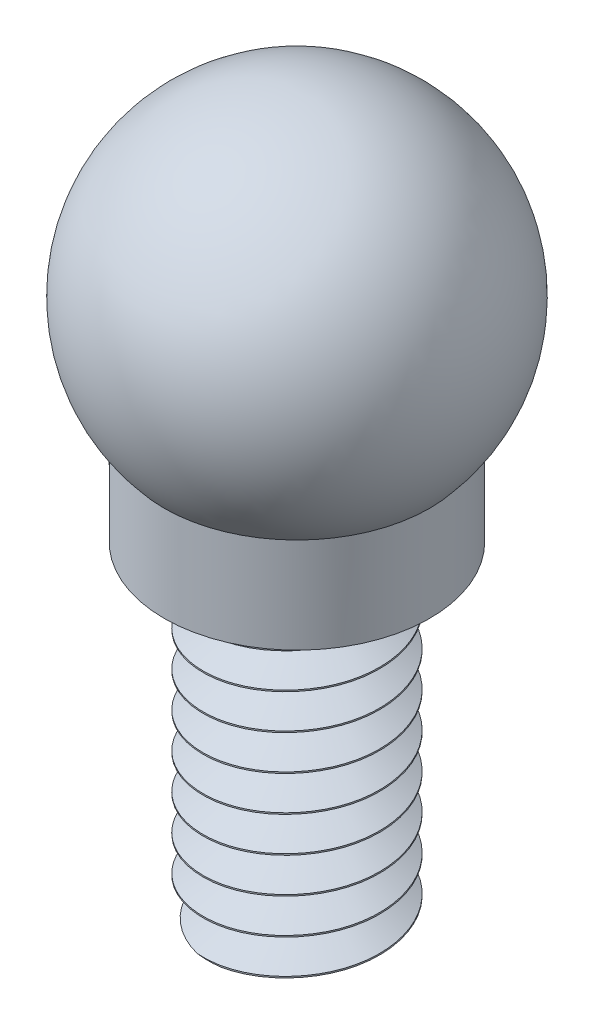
ISO-10303-21;
HEADER;
FILE_DESCRIPTION(('STEP AP214'),'2;1');
FILE_NAME('part.step','',(''),(''),'','','');
FILE_SCHEMA(('AUTOMOTIVE_DESIGN { 1 0 10303 214 1 1 1 1 }'));
ENDSEC;
DATA;
#1=APPLICATION_CONTEXT('core data for automotive mechanical design processes');
#2=APPLICATION_PROTOCOL_DEFINITION('international standard','automotive_design',2000,#1);
#3=PRODUCT_CONTEXT('',#1,'mechanical');
#4=PRODUCT('Part','Part','',(#3));
#5=PRODUCT_RELATED_PRODUCT_CATEGORY('part','',(#4));
#6=PRODUCT_DEFINITION_FORMATION('','',#4);
#7=PRODUCT_DEFINITION_CONTEXT('part definition',#1,'design');
#8=PRODUCT_DEFINITION('design','',#6,#7);
#9=PRODUCT_DEFINITION_SHAPE('','',#8);
#10=(LENGTH_UNIT() NAMED_UNIT(*) SI_UNIT(.MILLI.,.METRE.));
#11=(NAMED_UNIT(*) PLANE_ANGLE_UNIT() SI_UNIT($,.RADIAN.));
#12=(NAMED_UNIT(*) SI_UNIT($,.STERADIAN.) SOLID_ANGLE_UNIT());
#13=UNCERTAINTY_MEASURE_WITH_UNIT(LENGTH_MEASURE(1.E-05),#10,'distance_accuracy_value','');
#14=(GEOMETRIC_REPRESENTATION_CONTEXT(3) GLOBAL_UNCERTAINTY_ASSIGNED_CONTEXT((#13)) GLOBAL_UNIT_ASSIGNED_CONTEXT((#10,
#11,#12)) REPRESENTATION_CONTEXT('',''));
#15=CARTESIAN_POINT('',(0.,0.,0.));
#16=DIRECTION('',(0.,0.,1.));
#17=DIRECTION('',(1.,0.,0.));
#18=AXIS2_PLACEMENT_3D('',#15,#16,#17);
#19=CARTESIAN_POINT('',(0.,-19.05,0.));
#20=DIRECTION('',(0.,1.,0.));
#21=DIRECTION('',(0.,0.,1.));
#22=AXIS2_PLACEMENT_3D('',#19,#20,#21);
#23=PLANE('',#22);
#24=CARTESIAN_POINT('',(-0.423556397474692,-19.05,3.14662120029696));
#25=CARTESIAN_POINT('',(-0.506198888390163,-19.05,3.12638775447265));
#26=CARTESIAN_POINT('',(-0.587981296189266,-19.05,3.10265496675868));
#27=CARTESIAN_POINT('',(-0.749255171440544,-19.05,3.04838755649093));
#28=CARTESIAN_POINT('',(-0.828746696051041,-19.05,3.01785310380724));
#29=CARTESIAN_POINT('',(-0.984700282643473,-19.05,2.95025270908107));
#30=CARTESIAN_POINT('',(-1.06116863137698,-19.05,2.91320130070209));
#31=CARTESIAN_POINT('',(-1.21069290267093,-19.05,2.8328013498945));
#32=CARTESIAN_POINT('',(-1.28374891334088,-19.05,2.78945297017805));
#33=CARTESIAN_POINT('',(-1.4970292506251,-19.05,2.65037616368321));
#34=CARTESIAN_POINT('',(-1.63147721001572,-19.05,2.5455676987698));
#35=CARTESIAN_POINT('',(-1.88088934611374,-19.05,2.31470448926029));
#36=CARTESIAN_POINT('',(-1.99583741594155,-19.05,2.18863235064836));
#37=CARTESIAN_POINT('',(-2.15095353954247,-19.05,1.98663827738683));
#38=CARTESIAN_POINT('',(-2.19975142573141,-19.05,1.91720301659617));
#39=CARTESIAN_POINT('',(-2.26843996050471,-19.05,1.81015070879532));
#40=CARTESIAN_POINT('',(-2.29058865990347,-19.05,1.77397598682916));
#41=CARTESIAN_POINT('',(-2.33334742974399,-19.05,1.70072260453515));
#42=CARTESIAN_POINT('',(-2.35395736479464,-19.05,1.66364386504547));
#43=CARTESIAN_POINT('',(-2.39357384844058,-19.05,1.58867205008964));
#44=CARTESIAN_POINT('',(-2.41258144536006,-19.05,1.55077952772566));
#45=CARTESIAN_POINT('',(-2.44902571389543,-19.05,1.47424734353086));
#46=CARTESIAN_POINT('',(-2.46646247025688,-19.05,1.4356077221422));
#47=CARTESIAN_POINT('',(-2.49950103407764,-19.05,1.35756026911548));
#48=CARTESIAN_POINT('',(-2.51510334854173,-19.05,1.3181526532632));
#49=CARTESIAN_POINT('',(-2.54440258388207,-19.05,1.23863934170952));
#50=CARTESIAN_POINT('',(-2.55809949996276,-19.05,1.19853364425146));
#51=CARTESIAN_POINT('',(-2.59554275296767,-19.05,1.07969366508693));
#52=CARTESIAN_POINT('',(-2.61662645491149,-19.05,1.0001011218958));
#53=CARTESIAN_POINT('',(-2.65132393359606,-19.05,0.839299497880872));
#54=CARTESIAN_POINT('',(-2.66493602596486,-19.05,0.758090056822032));
#55=CARTESIAN_POINT('',(-2.68455487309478,-19.05,0.59478729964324));
#56=CARTESIAN_POINT('',(-2.69056519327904,-19.05,0.512694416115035));
#57=CARTESIAN_POINT('',(-2.69493343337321,-19.05,0.348339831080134));
#58=CARTESIAN_POINT('',(-2.69329262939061,-19.05,0.266078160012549));
#59=CARTESIAN_POINT('',(-2.67789219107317,-19.05,0.0352628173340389));
#60=CARTESIAN_POINT('',(-2.65536175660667,-19.05,-0.112794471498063));
#61=CARTESIAN_POINT('',(-2.58561606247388,-19.05,-0.403098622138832));
#62=CARTESIAN_POINT('',(-2.53838212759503,-19.05,-0.545341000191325));
#63=CARTESIAN_POINT('',(-2.45022998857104,-19.05,-0.750891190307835));
#64=CARTESIAN_POINT('',(-2.41800713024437,-19.05,-0.818036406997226));
#65=CARTESIAN_POINT('',(-2.36551903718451,-19.05,-0.916548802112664));
#66=CARTESIAN_POINT('',(-2.34732638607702,-19.05,-0.949025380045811));
#67=CARTESIAN_POINT('',(-2.3095864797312,-19.05,-1.01318613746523));
#68=CARTESIAN_POINT('',(-2.29003910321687,-19.05,-1.04487024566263));
#69=CARTESIAN_POINT('',(-2.24964903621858,-19.05,-1.10735778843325));
#70=CARTESIAN_POINT('',(-2.22880767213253,-19.05,-1.13816207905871));
#71=CARTESIAN_POINT('',(-2.19658623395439,-19.05,-1.18368545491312));
#72=CARTESIAN_POINT('',(-2.18568579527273,-19.05,-1.19874614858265));
#73=CARTESIAN_POINT('',(-2.16357889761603,-19.05,-1.22864110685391));
#74=CARTESIAN_POINT('',(-2.15237244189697,-19.05,-1.24347537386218));
#75=CARTESIAN_POINT('',(-2.11822680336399,-19.05,-1.28755699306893));
#76=CARTESIAN_POINT('',(-2.0947534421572,-19.05,-1.31639445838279));
#77=CARTESIAN_POINT('',(-2.04643865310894,-19.05,-1.37289248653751));
#78=CARTESIAN_POINT('',(-2.02159723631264,-19.05,-1.40055305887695));
#79=CARTESIAN_POINT('',(-1.94675053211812,-19.05,-1.47992615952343));
#80=CARTESIAN_POINT('',(-1.89493026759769,-19.05,-1.52995057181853));
#81=CARTESIAN_POINT('',(-1.78680816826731,-19.05,-1.6249052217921));
#82=CARTESIAN_POINT('',(-1.73050517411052,-19.05,-1.66983413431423));
#83=CARTESIAN_POINT('',(-1.61390685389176,-19.05,-1.75418373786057));
#84=CARTESIAN_POINT('',(-1.55361165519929,-19.05,-1.79360460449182));
#85=CARTESIAN_POINT('',(-1.4295968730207,-19.05,-1.86656021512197));
#86=CARTESIAN_POINT('',(-1.36587796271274,-19.05,-1.90009611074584));
#87=CARTESIAN_POINT('',(-1.18423215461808,-19.05,-1.98494339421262));
#88=CARTESIAN_POINT('',(-1.06306686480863,-19.05,-2.02950508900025));
#89=CARTESIAN_POINT('',(-0.815050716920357,-19.05,-2.09747428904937));
#90=CARTESIAN_POINT('',(-0.688203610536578,-19.05,-2.12089554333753));
#91=CARTESIAN_POINT('',(-0.467067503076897,-19.05,-2.14260998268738));
#92=CARTESIAN_POINT('',(-0.373248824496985,-19.05,-2.14598513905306));
#93=CARTESIAN_POINT('',(-0.186010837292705,-19.05,-2.14119436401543));
#94=CARTESIAN_POINT('',(-0.0925912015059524,-19.05,-2.13304120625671));
#95=CARTESIAN_POINT('',(0.,-19.05,-2.11914182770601));
#96=B_SPLINE_CURVE_WITH_KNOTS('',3,(#24,#25,#26,#27,#28,#29,#30,#31,#32,#33,#34,#35,#36,#37,#38,
#39,#40,#41,#42,#43,#44,#45,#46,#47,#48,#49,#50,#51,#52,#53,#54,#55,#56,#57,#58,#59,#60,#61,#62,
#63,#64,#65,#66,#67,#68,#69,#70,#71,#72,#73,#74,#75,#76,#77,#78,#79,#80,#81,#82,#83,#84,#85,#86,
#87,#88,#89,#90,#91,#92,#93,#94,#95),.UNSPECIFIED.,.F.,.F.,(4,2,2,2,2,2,2,2,2,2,2,2,2,2,2,2,2,2,
2,2,2,2,2,2,2,2,2,2,2,2,2,2,2,2,2,4),(0.,0.255168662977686,0.510330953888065,0.764931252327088,
1.01952497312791,1.52835291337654,2.0375991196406,2.29192910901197,2.4191440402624,
2.54637015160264,2.67351236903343,2.80064772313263,2.92774785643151,3.05484830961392,
3.30147575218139,3.54815877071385,3.79472604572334,4.04125219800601,4.48827484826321,
4.93563592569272,5.15882807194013,5.27047173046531,5.38212539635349,5.49366644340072,
5.54943756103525,5.60520808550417,5.71670781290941,5.82820664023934,6.04393724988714,
6.25972383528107,6.47550353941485,6.69124097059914,7.07656585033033,7.4616399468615,
7.74259576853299,8.02324052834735),.UNSPECIFIED.);
#97=CARTESIAN_POINT('',(-0.423556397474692,-19.05,3.14662120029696));
#98=VERTEX_POINT('',#97);
#99=CARTESIAN_POINT('',(0.,-19.05,-2.11914182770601));
#100=VERTEX_POINT('',#99);
#101=EDGE_CURVE('E74',#98,#100,#96,.T.);
#102=ORIENTED_EDGE('',*,*,#101,.T.);
#103=CARTESIAN_POINT('',(0.,-19.05,-2.11914182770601));
#104=CARTESIAN_POINT('',(0.0570503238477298,-19.05,-2.12769012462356));
#105=CARTESIAN_POINT('',(0.114404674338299,-19.05,-2.13407357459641));
#106=CARTESIAN_POINT('',(0.229426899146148,-19.05,-2.14247895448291));
#107=CARTESIAN_POINT('',(0.287094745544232,-19.05,-2.14450126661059));
#108=CARTESIAN_POINT('',(0.460091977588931,-19.05,-2.14398059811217));
#109=CARTESIAN_POINT('',(0.575464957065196,-19.05,-2.13485746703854));
#110=CARTESIAN_POINT('',(0.816036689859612,-19.05,-2.09723559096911));
#111=CARTESIAN_POINT('',(0.940919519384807,-19.05,-2.06671508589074));
#112=CARTESIAN_POINT('',(1.18375292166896,-19.05,-1.98512148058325));
#113=CARTESIAN_POINT('',(1.30170383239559,-19.05,-1.93404938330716));
#114=CARTESIAN_POINT('',(1.52725130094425,-19.05,-1.8128720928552));
#115=CARTESIAN_POINT('',(1.63486203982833,-19.05,-1.74279348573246));
#116=CARTESIAN_POINT('',(1.78626252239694,-19.05,-1.62505268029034));
#117=CARTESIAN_POINT('',(1.83507534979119,-19.05,-1.58368530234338));
#118=CARTESIAN_POINT('',(1.92908140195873,-19.05,-1.49700603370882));
#119=CARTESIAN_POINT('',(1.97427533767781,-19.05,-1.45169492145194));
#120=CARTESIAN_POINT('',(2.03914909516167,-19.05,-1.38098817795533));
#121=CARTESIAN_POINT('',(2.06031062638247,-19.05,-1.35693271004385));
#122=CARTESIAN_POINT('',(2.10160406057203,-19.05,-1.30795109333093));
#123=CARTESIAN_POINT('',(2.12173597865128,-19.05,-1.28302495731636));
#124=CARTESIAN_POINT('',(2.16097389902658,-19.05,-1.23237238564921));
#125=CARTESIAN_POINT('',(2.18007969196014,-19.05,-1.20664578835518));
#126=CARTESIAN_POINT('',(2.21737321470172,-19.05,-1.15453698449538));
#127=CARTESIAN_POINT('',(2.23556090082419,-19.05,-1.12815474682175));
#128=CARTESIAN_POINT('',(2.28869268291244,-19.05,-1.04799540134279));
#129=CARTESIAN_POINT('',(2.32218000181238,-19.05,-0.993238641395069));
#130=CARTESIAN_POINT('',(2.38508596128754,-19.05,-0.881471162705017));
#131=CARTESIAN_POINT('',(2.41450509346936,-19.05,-0.824460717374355));
#132=CARTESIAN_POINT('',(2.50257765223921,-19.05,-0.637345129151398));
#133=CARTESIAN_POINT('',(2.55293139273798,-19.05,-0.50319529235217));
#134=CARTESIAN_POINT('',(2.63130790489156,-19.05,-0.22865904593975));
#135=CARTESIAN_POINT('',(2.65933501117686,-19.05,-0.0882738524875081));
#136=CARTESIAN_POINT('',(2.69308208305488,-19.05,0.201224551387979));
#137=CARTESIAN_POINT('',(2.6978201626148,-19.05,0.350457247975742));
#138=CARTESIAN_POINT('',(2.68616338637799,-19.05,0.573124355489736));
#139=CARTESIAN_POINT('',(2.67914571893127,-19.05,0.647171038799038));
#140=CARTESIAN_POINT('',(2.65892459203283,-19.05,0.794433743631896));
#141=CARTESIAN_POINT('',(2.64572141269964,-19.05,0.867649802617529));
#142=CARTESIAN_POINT('',(2.61320452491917,-19.05,1.01278980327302));
#143=CARTESIAN_POINT('',(2.59388390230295,-19.05,1.08471218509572));
#144=CARTESIAN_POINT('',(2.54929963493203,-19.05,1.2267022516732));
#145=CARTESIAN_POINT('',(2.52403617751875,-19.05,1.296769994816));
#146=CARTESIAN_POINT('',(2.48176776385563,-19.05,1.40008539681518));
#147=CARTESIAN_POINT('',(2.46694189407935,-19.05,1.43424087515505));
#148=CARTESIAN_POINT('',(2.43604174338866,-19.05,1.50198315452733));
#149=CARTESIAN_POINT('',(2.41996740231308,-19.05,1.53556992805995));
#150=CARTESIAN_POINT('',(2.36989421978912,-19.05,1.63541154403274));
#151=CARTESIAN_POINT('',(2.33404458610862,-19.05,1.70074921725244));
#152=CARTESIAN_POINT('',(2.25549785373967,-19.05,1.83212735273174));
#153=CARTESIAN_POINT('',(2.21253179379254,-19.05,1.89800703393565));
#154=CARTESIAN_POINT('',(2.12160505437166,-19.05,2.02619174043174));
#155=CARTESIAN_POINT('',(2.07364497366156,-19.05,2.08849719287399));
#156=CARTESIAN_POINT('',(1.92268473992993,-19.05,2.26947251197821));
#157=CARTESIAN_POINT('',(1.81253818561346,-19.05,2.38231225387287));
#158=CARTESIAN_POINT('',(1.56670414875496,-19.05,2.5975868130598));
#159=CARTESIAN_POINT('',(1.42968680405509,-19.05,2.69849695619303));
#160=CARTESIAN_POINT('',(1.14066465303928,-19.05,2.875845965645));
#161=CARTESIAN_POINT('',(0.988671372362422,-19.05,2.95230346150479));
#162=CARTESIAN_POINT('',(0.765116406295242,-19.05,3.04213262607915));
#163=CARTESIAN_POINT('',(0.697778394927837,-19.05,3.0664420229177));
#164=CARTESIAN_POINT('',(0.561687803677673,-19.05,3.11018276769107));
#165=CARTESIAN_POINT('',(0.492938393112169,-19.05,3.1296239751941));
#166=CARTESIAN_POINT('',(0.423556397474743,-19.05,3.14662120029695));
#167=B_SPLINE_CURVE_WITH_KNOTS('',3,(#103,#104,#105,#106,#107,#108,#109,#110,#111,#112,#113,
#114,#115,#116,#117,#118,#119,#120,#121,#122,#123,#124,#125,#126,#127,#128,#129,#130,#131,#132,
#133,#134,#135,#136,#137,#138,#139,#140,#141,#142,#143,#144,#145,#146,#147,#148,#149,#150,#151,
#152,#153,#154,#155,#156,#157,#158,#159,#160,#161,#162,#163,#164,#165,#166),.UNSPECIFIED.,.F.,
.F.,(4,2,2,2,2,2,2,2,2,2,2,2,2,2,2,2,2,2,2,2,2,2,2,2,2,2,2,2,2,2,2,4),(0.,0.172979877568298,
0.345944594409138,0.691724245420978,1.075556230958,1.45936948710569,1.84264861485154,
2.0344219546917,2.2261575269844,2.32225133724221,2.41834373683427,2.51445566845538,
2.6105721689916,2.80292995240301,2.99526447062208,3.4230498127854,3.85075208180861,
4.29634059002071,4.51926418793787,4.74217769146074,4.96534404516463,5.18850336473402,
5.30018187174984,5.41186576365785,5.63522857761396,5.87093776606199,6.10661872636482,
6.57759705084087,7.08575683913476,7.59352855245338,7.80815708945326,8.0223473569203),.UNSPECIFIED.);
#168=CARTESIAN_POINT('',(0.423556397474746,-19.05,3.14662120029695));
#169=VERTEX_POINT('',#168);
#170=EDGE_CURVE('E61',#100,#169,#167,.T.);
#171=ORIENTED_EDGE('',*,*,#170,.T.);
#172=CARTESIAN_POINT('',(0.,-19.05,0.));
#173=DIRECTION('',(0.,1.,0.));
#174=DIRECTION('',(0.,0.,1.));
#175=AXIS2_PLACEMENT_3D('',#172,#173,#174);
#176=CIRCLE('',#175,3.175);
#177=EDGE_CURVE('E11',#98,#169,#176,.T.);
#178=ORIENTED_EDGE('',*,*,#177,.F.);
#179=EDGE_LOOP('',(#102,#171,#178));
#180=FACE_BOUND('',#179,.T.);
#181=ADVANCED_FACE('F30',(#180),#23,.F.);
#182=CARTESIAN_POINT('',(0.,0.,0.));
#183=DIRECTION('',(0.,1.,0.));
#184=DIRECTION('',(0.,0.,1.));
#185=AXIS2_PLACEMENT_3D('',#182,#183,#184);
#186=CYLINDRICAL_SURFACE('',#185,3.175);
#187=CARTESIAN_POINT('',(0.,-20.9296,-3.175));
#188=CARTESIAN_POINT('',(-1.83308710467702,-20.8237666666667,-3.17500000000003));
#189=CARTESIAN_POINT('',(-2.74963065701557,-20.7179333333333,-1.58750000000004));
#190=CARTESIAN_POINT('',(-3.66617420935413,-20.6121,0.));
#191=CARTESIAN_POINT('',(-2.74963065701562,-20.5062666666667,1.58749999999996));
#192=CARTESIAN_POINT('',(-1.83308710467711,-20.4004333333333,3.17499999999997));
#193=CARTESIAN_POINT('',(0.,-20.2946,3.175));
#194=CARTESIAN_POINT('',(1.83308710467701,-20.1887666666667,3.17500000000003));
#195=CARTESIAN_POINT('',(2.74963065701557,-20.0829333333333,1.58750000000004));
#196=CARTESIAN_POINT('',(3.66617420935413,-19.9771,0.));
#197=CARTESIAN_POINT('',(2.74963065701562,-19.8712666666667,-1.58749999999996));
#198=CARTESIAN_POINT('',(1.83308710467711,-19.7654333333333,-3.17499999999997));
#199=CARTESIAN_POINT('',(0.,-19.6596,-3.175));
#200=CARTESIAN_POINT('',(-1.83308710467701,-19.5537666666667,-3.17500000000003));
#201=CARTESIAN_POINT('',(-2.74963065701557,-19.4479333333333,-1.58750000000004));
#202=CARTESIAN_POINT('',(-3.66617420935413,-19.3421,0.));
#203=CARTESIAN_POINT('',(-2.74963065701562,-19.2362666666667,1.58749999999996));
#204=CARTESIAN_POINT('',(-1.83308710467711,-19.1304333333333,3.17499999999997));
#205=CARTESIAN_POINT('',(0.,-19.0246,3.175));
#206=CARTESIAN_POINT('',(1.83308710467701,-18.9187666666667,3.17500000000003));
#207=CARTESIAN_POINT('',(2.74963065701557,-18.8129333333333,1.58750000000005));
#208=CARTESIAN_POINT('',(3.66617420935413,-18.7071,0.));
#209=CARTESIAN_POINT('',(2.74963065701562,-18.6012666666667,-1.58749999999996));
#210=CARTESIAN_POINT('',(1.83308710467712,-18.4954333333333,-3.17499999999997));
#211=CARTESIAN_POINT('',(0.,-18.3896,-3.175));
#212=CARTESIAN_POINT('',(-1.83308710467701,-18.2837666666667,-3.17500000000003));
#213=CARTESIAN_POINT('',(-2.74963065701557,-18.1779333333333,-1.58750000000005));
#214=CARTESIAN_POINT('',(-3.66617420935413,-18.0721,0.));
#215=CARTESIAN_POINT('',(-2.74963065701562,-17.9662666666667,1.58749999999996));
#216=CARTESIAN_POINT('',(-1.83308710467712,-17.8604333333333,3.17499999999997));
#217=CARTESIAN_POINT('',(0.,-17.7546,3.175));
#218=CARTESIAN_POINT('',(1.83308710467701,-17.6487666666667,3.17500000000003));
#219=CARTESIAN_POINT('',(2.74963065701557,-17.5429333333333,1.58750000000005));
#220=CARTESIAN_POINT('',(3.66617420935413,-17.4371,0.));
#221=CARTESIAN_POINT('',(2.74963065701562,-17.3312666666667,-1.58749999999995));
#222=CARTESIAN_POINT('',(1.83308710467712,-17.2254333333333,-3.17499999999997));
#223=CARTESIAN_POINT('',(0.,-17.1196,-3.175));
#224=CARTESIAN_POINT('',(-1.83308710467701,-17.0137666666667,-3.17500000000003));
#225=CARTESIAN_POINT('',(-2.74963065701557,-16.9079333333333,-1.58750000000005));
#226=CARTESIAN_POINT('',(-3.66617420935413,-16.8021,0.));
#227=CARTESIAN_POINT('',(-2.74963065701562,-16.6962666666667,1.58749999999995));
#228=CARTESIAN_POINT('',(-1.83308710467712,-16.5904333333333,3.17499999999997));
#229=CARTESIAN_POINT('',(0.,-16.4846,3.175));
#230=CARTESIAN_POINT('',(1.83308710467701,-16.3787666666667,3.17500000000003));
#231=CARTESIAN_POINT('',(2.74963065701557,-16.2729333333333,1.58750000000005));
#232=CARTESIAN_POINT('',(3.66617420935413,-16.1671,0.));
#233=CARTESIAN_POINT('',(2.74963065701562,-16.0612666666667,-1.58749999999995));
#234=CARTESIAN_POINT('',(1.83308710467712,-15.9554333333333,-3.17499999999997));
#235=CARTESIAN_POINT('',(0.,-15.8496,-3.175));
#236=CARTESIAN_POINT('',(-1.83308710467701,-15.7437666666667,-3.17500000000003));
#237=CARTESIAN_POINT('',(-2.74963065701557,-15.6379333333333,-1.58750000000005));
#238=CARTESIAN_POINT('',(-3.66617420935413,-15.5321,0.));
#239=CARTESIAN_POINT('',(-2.74963065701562,-15.4262666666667,1.58749999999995));
#240=CARTESIAN_POINT('',(-1.83308710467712,-15.3204333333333,3.17499999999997));
#241=CARTESIAN_POINT('',(0.,-15.2146,3.175));
#242=CARTESIAN_POINT('',(1.83308710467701,-15.1087666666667,3.17500000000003));
#243=CARTESIAN_POINT('',(2.74963065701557,-15.0029333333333,1.58750000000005));
#244=CARTESIAN_POINT('',(3.66617420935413,-14.8971,0.));
#245=CARTESIAN_POINT('',(2.74963065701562,-14.7912666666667,-1.58749999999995));
#246=CARTESIAN_POINT('',(1.83308710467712,-14.6854333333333,-3.17499999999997));
#247=CARTESIAN_POINT('',(0.,-14.5796,-3.175));
#248=CARTESIAN_POINT('',(-1.83308710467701,-14.4737666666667,-3.17500000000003));
#249=CARTESIAN_POINT('',(-2.74963065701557,-14.3679333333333,-1.58750000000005));
#250=CARTESIAN_POINT('',(-3.66617420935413,-14.2621,0.));
#251=CARTESIAN_POINT('',(-2.74963065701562,-14.1562666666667,1.58749999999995));
#252=CARTESIAN_POINT('',(-1.83308710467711,-14.0504333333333,3.17499999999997));
#253=CARTESIAN_POINT('',(0.,-13.9446,3.175));
#254=CARTESIAN_POINT('',(1.83308710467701,-13.8387666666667,3.17500000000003));
#255=CARTESIAN_POINT('',(2.74963065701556,-13.7329333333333,1.58750000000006));
#256=CARTESIAN_POINT('',(3.66617420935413,-13.6271,0.));
#257=CARTESIAN_POINT('',(2.74963065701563,-13.5212666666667,-1.58749999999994));
#258=CARTESIAN_POINT('',(1.83308710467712,-13.4154333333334,-3.17499999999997));
#259=CARTESIAN_POINT('',(0.,-13.3096,-3.175));
#260=CARTESIAN_POINT('',(-1.833087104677,-13.2037666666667,-3.17500000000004));
#261=CARTESIAN_POINT('',(-2.74963065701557,-13.0979333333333,-1.58750000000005));
#262=CARTESIAN_POINT('',(-3.66617420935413,-12.9921,0.));
#263=CARTESIAN_POINT('',(-2.74963065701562,-12.8862666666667,1.58749999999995));
#264=CARTESIAN_POINT('',(-1.83308710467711,-12.7804333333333,3.17499999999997));
#265=CARTESIAN_POINT('',(0.,-12.6746,3.175));
#266=CARTESIAN_POINT('',(1.83308710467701,-12.5687666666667,3.17500000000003));
#267=CARTESIAN_POINT('',(2.74963065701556,-12.4629333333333,1.58750000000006));
#268=CARTESIAN_POINT('',(3.66617420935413,-12.3571,0.));
#269=CARTESIAN_POINT('',(2.74963065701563,-12.2512666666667,-1.58749999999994));
#270=CARTESIAN_POINT('',(1.83308710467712,-12.1454333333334,-3.17499999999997));
#271=CARTESIAN_POINT('',(0.,-12.0396,-3.175));
#272=CARTESIAN_POINT('',(-1.833087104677,-11.9337666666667,-3.17500000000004));
#273=CARTESIAN_POINT('',(-2.74963065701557,-11.8279333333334,-1.58750000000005));
#274=CARTESIAN_POINT('',(-3.66617420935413,-11.7221,0.));
#275=CARTESIAN_POINT('',(-2.74963065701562,-11.6162666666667,1.58749999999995));
#276=CARTESIAN_POINT('',(-1.83308710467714,-11.5104333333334,3.17499999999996));
#277=CARTESIAN_POINT('',(0.,-11.4046,3.175));
#278=CARTESIAN_POINT('',(1.83308710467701,-11.2987666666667,3.17500000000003));
#279=CARTESIAN_POINT('',(2.74963065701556,-11.1929333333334,1.58750000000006));
#280=CARTESIAN_POINT('',(3.66617420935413,-11.0871,0.));
#281=CARTESIAN_POINT('',(2.74963065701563,-10.9812666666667,-1.58749999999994));
#282=CARTESIAN_POINT('',(1.83308710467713,-10.8754333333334,-3.17499999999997));
#283=CARTESIAN_POINT('',(0.,-10.7696,-3.175));
#284=CARTESIAN_POINT('',(-1.833087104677,-10.6637666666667,-3.17500000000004));
#285=CARTESIAN_POINT('',(-2.74963065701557,-10.5579333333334,-1.58750000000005));
#286=CARTESIAN_POINT('',(-3.66617420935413,-10.4521,0.));
#287=CARTESIAN_POINT('',(-2.74963065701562,-10.3462666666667,1.58749999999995));
#288=CARTESIAN_POINT('',(-1.83308710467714,-10.2404333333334,3.17499999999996));
#289=CARTESIAN_POINT('',(0.,-10.1346,3.175));
#290=CARTESIAN_POINT('',(1.83308710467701,-10.0287666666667,3.17500000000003));
#291=CARTESIAN_POINT('',(2.74963065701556,-9.92293333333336,1.58750000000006));
#292=CARTESIAN_POINT('',(3.66617420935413,-9.81710000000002,0.));
#293=CARTESIAN_POINT('',(2.74963065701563,-9.71126666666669,-1.58749999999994));
#294=CARTESIAN_POINT('',(1.83308710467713,-9.60543333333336,-3.17499999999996));
#295=CARTESIAN_POINT('',(0.,-9.49960000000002,-3.175));
#296=CARTESIAN_POINT('',(-1.833087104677,-9.39376666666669,-3.17500000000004));
#297=CARTESIAN_POINT('',(-2.74963065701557,-9.28793333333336,-1.58750000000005));
#298=CARTESIAN_POINT('',(-3.66617420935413,-9.18210000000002,0.));
#299=CARTESIAN_POINT('',(-2.74963065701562,-9.07626666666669,1.58749999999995));
#300=CARTESIAN_POINT('',(-1.83308710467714,-8.97043333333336,3.17499999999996));
#301=CARTESIAN_POINT('',(0.,-8.86460000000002,3.175));
#302=CARTESIAN_POINT('',(1.83308710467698,-8.75876666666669,3.17500000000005));
#303=CARTESIAN_POINT('',(2.74963065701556,-8.65293333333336,1.58750000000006));
#304=CARTESIAN_POINT('',(3.66617420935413,-8.54710000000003,0.));
#305=CARTESIAN_POINT('',(2.74963065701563,-8.44126666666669,-1.58749999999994));
#306=CARTESIAN_POINT('',(1.83308710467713,-8.33543333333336,-3.17499999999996));
#307=CARTESIAN_POINT('',(0.,-8.22960000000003,-3.175));
#308=CARTESIAN_POINT('',(-1.83308710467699,-8.12376666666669,-3.17500000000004));
#309=CARTESIAN_POINT('',(-2.74963065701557,-8.01793333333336,-1.58750000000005));
#310=CARTESIAN_POINT('',(-3.66617420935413,-7.91210000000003,0.));
#311=CARTESIAN_POINT('',(-2.74963065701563,-7.80626666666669,1.58749999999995));
#312=CARTESIAN_POINT('',(-1.83308710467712,-7.70043333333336,3.17499999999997));
#313=CARTESIAN_POINT('',(0.,-7.59460000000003,3.175));
#314=CARTESIAN_POINT('',(1.83308710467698,-7.48876666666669,3.17500000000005));
#315=CARTESIAN_POINT('',(2.74963065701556,-7.38293333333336,1.58750000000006));
#316=CARTESIAN_POINT('',(3.66617420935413,-7.27710000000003,0.));
#317=CARTESIAN_POINT('',(2.74963065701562,-7.17126666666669,-1.58749999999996));
#318=CARTESIAN_POINT('',(1.83308710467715,-7.06543333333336,-3.17499999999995));
#319=CARTESIAN_POINT('',(0.,-6.95960000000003,-3.175));
#320=(BOUNDED_CURVE() B_SPLINE_CURVE(2,(#187,#188,#189,#190,#191,#192,#193,#194,#195,#196,#197,
#198,#199,#200,#201,#202,#203,#204,#205,#206,#207,#208,#209,#210,#211,#212,#213,#214,#215,#216,
#217,#218,#219,#220,#221,#222,#223,#224,#225,#226,#227,#228,#229,#230,#231,#232,#233,#234,#235,
#236,#237,#238,#239,#240,#241,#242,#243,#244,#245,#246,#247,#248,#249,#250,#251,#252,#253,#254,
#255,#256,#257,#258,#259,#260,#261,#262,#263,#264,#265,#266,#267,#268,#269,#270,#271,#272,#273,
#274,#275,#276,#277,#278,#279,#280,#281,#282,#283,#284,#285,#286,#287,#288,#289,#290,#291,#292,
#293,#294,#295,#296,#297,#298,#299,#300,#301,#302,#303,#304,#305,#306,#307,#308,#309,#310,#311,
#312,#313,#314,#315,#316,#317,#318,#319),.UNSPECIFIED.,.F.,.F.) B_SPLINE_CURVE_WITH_KNOTS((3,2,
2,2,2,2,2,2,2,2,2,2,2,2,2,2,2,2,2,2,2,2,2,2,2,2,2,2,2,2,2,2,2,2,2,2,2,2,2,2,2,2,2,2,2,2,2,2,2,2,
2,2,2,2,2,2,2,2,2,2,2,2,2,2,2,2,3),(0.,0.0151515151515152,0.0303030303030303,0.0454545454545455,
0.0606060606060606,0.0757575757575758,0.0909090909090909,0.106060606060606,0.121212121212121,
0.136363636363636,0.151515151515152,0.166666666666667,0.181818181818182,0.196969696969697,
0.212121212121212,0.227272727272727,0.242424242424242,0.257575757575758,0.272727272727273,
0.287878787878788,0.303030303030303,0.318181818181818,0.333333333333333,0.348484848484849,
0.363636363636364,0.378787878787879,0.393939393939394,0.409090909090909,0.424242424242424,
0.439393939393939,0.454545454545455,0.46969696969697,0.484848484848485,0.5,0.515151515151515,
0.53030303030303,0.545454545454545,0.560606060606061,0.575757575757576,0.590909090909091,
0.606060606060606,0.621212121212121,0.636363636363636,0.651515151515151,0.666666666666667,
0.681818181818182,0.696969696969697,0.712121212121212,0.727272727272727,0.742424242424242,
0.757575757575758,0.772727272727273,0.787878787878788,0.803030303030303,0.818181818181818,
0.833333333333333,0.848484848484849,0.863636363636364,0.878787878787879,0.893939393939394,
0.909090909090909,0.924242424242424,0.939393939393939,0.954545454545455,0.96969696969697,
0.984848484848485,1.),
.UNSPECIFIED.) CURVE() GEOMETRIC_REPRESENTATION_ITEM() RATIONAL_B_SPLINE_CURVE((1.,
0.866025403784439,1.,0.866025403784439,1.,0.866025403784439,1.,0.866025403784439,1.,
0.866025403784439,1.,0.866025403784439,1.,0.866025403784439,1.,0.866025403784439,1.,
0.866025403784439,1.,0.866025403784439,1.,0.866025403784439,1.,0.866025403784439,1.,
0.866025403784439,1.,0.866025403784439,1.,0.866025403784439,1.,0.866025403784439,1.,
0.866025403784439,1.,0.866025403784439,1.,0.866025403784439,1.,0.866025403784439,1.,
0.866025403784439,1.,0.866025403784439,1.,0.866025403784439,1.,0.866025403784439,1.,
0.866025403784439,1.,0.866025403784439,1.,0.866025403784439,1.,0.866025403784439,1.,
0.866025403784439,1.,0.866025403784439,1.,0.866025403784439,1.,0.866025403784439,1.,
0.866025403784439,1.,0.866025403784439,1.,0.866025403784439,1.,0.866025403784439,1.,
0.866025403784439,1.,0.866025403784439,1.,0.866025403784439,1.,0.866025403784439,1.,
0.866025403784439,1.,0.866025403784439,1.,0.866025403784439,1.,0.866025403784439,1.,
0.866025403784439,1.,0.866025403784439,1.,0.866025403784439,1.,0.866025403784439,1.,
0.866025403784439,1.,0.866025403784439,1.,0.866025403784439,1.,0.866025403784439,1.,
0.866025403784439,1.,0.866025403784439,1.,0.866025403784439,1.,0.866025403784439,1.,
0.866025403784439,1.,0.866025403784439,1.,0.866025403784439,1.,0.866025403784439,1.,
0.866025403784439,1.,0.866025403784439,1.,0.866025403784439,1.,0.866025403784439,1.,
0.866025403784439,1.,0.866025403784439,1.)) REPRESENTATION_ITEM(''));
#321=CARTESIAN_POINT('',(-0.423556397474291,-7.62,3.14662120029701));
#322=VERTEX_POINT('',#321);
#323=EDGE_CURVE('E78',#98,#322,#320,.T.);
#324=ORIENTED_EDGE('',*,*,#323,.F.);
#325=ORIENTED_EDGE('',*,*,#177,.T.);
#326=CARTESIAN_POINT('',(0.,-19.7104,-3.175));
#327=CARTESIAN_POINT('',(-1.83308710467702,-19.6045666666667,-3.17500000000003));
#328=CARTESIAN_POINT('',(-2.74963065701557,-19.4987333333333,-1.58750000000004));
#329=CARTESIAN_POINT('',(-3.66617420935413,-19.3929,0.));
#330=CARTESIAN_POINT('',(-2.74963065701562,-19.2870666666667,1.58749999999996));
#331=CARTESIAN_POINT('',(-1.83308710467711,-19.1812333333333,3.17499999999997));
#332=CARTESIAN_POINT('',(0.,-19.0754,3.175));
#333=CARTESIAN_POINT('',(1.83308710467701,-18.9695666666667,3.17500000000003));
#334=CARTESIAN_POINT('',(2.74963065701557,-18.8637333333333,1.58750000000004));
#335=CARTESIAN_POINT('',(3.66617420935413,-18.7579,0.));
#336=CARTESIAN_POINT('',(2.74963065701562,-18.6520666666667,-1.58749999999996));
#337=CARTESIAN_POINT('',(1.83308710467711,-18.5462333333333,-3.17499999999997));
#338=CARTESIAN_POINT('',(0.,-18.4404,-3.175));
#339=CARTESIAN_POINT('',(-1.83308710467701,-18.3345666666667,-3.17500000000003));
#340=CARTESIAN_POINT('',(-2.74963065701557,-18.2287333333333,-1.58750000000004));
#341=CARTESIAN_POINT('',(-3.66617420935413,-18.1229,0.));
#342=CARTESIAN_POINT('',(-2.74963065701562,-18.0170666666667,1.58749999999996));
#343=CARTESIAN_POINT('',(-1.83308710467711,-17.9112333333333,3.17499999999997));
#344=CARTESIAN_POINT('',(0.,-17.8054,3.175));
#345=CARTESIAN_POINT('',(1.83308710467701,-17.6995666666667,3.17500000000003));
#346=CARTESIAN_POINT('',(2.74963065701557,-17.5937333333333,1.58750000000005));
#347=CARTESIAN_POINT('',(3.66617420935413,-17.4879,0.));
#348=CARTESIAN_POINT('',(2.74963065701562,-17.3820666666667,-1.58749999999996));
#349=CARTESIAN_POINT('',(1.83308710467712,-17.2762333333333,-3.17499999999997));
#350=CARTESIAN_POINT('',(0.,-17.1704,-3.175));
#351=CARTESIAN_POINT('',(-1.83308710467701,-17.0645666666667,-3.17500000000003));
#352=CARTESIAN_POINT('',(-2.74963065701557,-16.9587333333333,-1.58750000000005));
#353=CARTESIAN_POINT('',(-3.66617420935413,-16.8529,0.));
#354=CARTESIAN_POINT('',(-2.74963065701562,-16.7470666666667,1.58749999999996));
#355=CARTESIAN_POINT('',(-1.83308710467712,-16.6412333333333,3.17499999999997));
#356=CARTESIAN_POINT('',(0.,-16.5354,3.175));
#357=CARTESIAN_POINT('',(1.83308710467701,-16.4295666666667,3.17500000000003));
#358=CARTESIAN_POINT('',(2.74963065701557,-16.3237333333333,1.58750000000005));
#359=CARTESIAN_POINT('',(3.66617420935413,-16.2179,0.));
#360=CARTESIAN_POINT('',(2.74963065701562,-16.1120666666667,-1.58749999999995));
#361=CARTESIAN_POINT('',(1.83308710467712,-16.0062333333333,-3.17499999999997));
#362=CARTESIAN_POINT('',(0.,-15.9004,-3.175));
#363=CARTESIAN_POINT('',(-1.83308710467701,-15.7945666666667,-3.17500000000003));
#364=CARTESIAN_POINT('',(-2.74963065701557,-15.6887333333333,-1.58750000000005));
#365=CARTESIAN_POINT('',(-3.66617420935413,-15.5829,0.));
#366=CARTESIAN_POINT('',(-2.74963065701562,-15.4770666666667,1.58749999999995));
#367=CARTESIAN_POINT('',(-1.83308710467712,-15.3712333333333,3.17499999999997));
#368=CARTESIAN_POINT('',(0.,-15.2654,3.175));
#369=CARTESIAN_POINT('',(1.83308710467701,-15.1595666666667,3.17500000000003));
#370=CARTESIAN_POINT('',(2.74963065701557,-15.0537333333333,1.58750000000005));
#371=CARTESIAN_POINT('',(3.66617420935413,-14.9479,0.));
#372=CARTESIAN_POINT('',(2.74963065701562,-14.8420666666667,-1.58749999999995));
#373=CARTESIAN_POINT('',(1.83308710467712,-14.7362333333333,-3.17499999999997));
#374=CARTESIAN_POINT('',(0.,-14.6304,-3.175));
#375=CARTESIAN_POINT('',(-1.83308710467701,-14.5245666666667,-3.17500000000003));
#376=CARTESIAN_POINT('',(-2.74963065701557,-14.4187333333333,-1.58750000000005));
#377=CARTESIAN_POINT('',(-3.66617420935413,-14.3129,0.));
#378=CARTESIAN_POINT('',(-2.74963065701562,-14.2070666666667,1.58749999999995));
#379=CARTESIAN_POINT('',(-1.83308710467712,-14.1012333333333,3.17499999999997));
#380=CARTESIAN_POINT('',(0.,-13.9954,3.175));
#381=CARTESIAN_POINT('',(1.83308710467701,-13.8895666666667,3.17500000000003));
#382=CARTESIAN_POINT('',(2.74963065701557,-13.7837333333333,1.58750000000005));
#383=CARTESIAN_POINT('',(3.66617420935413,-13.6779,0.));
#384=CARTESIAN_POINT('',(2.74963065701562,-13.5720666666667,-1.58749999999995));
#385=CARTESIAN_POINT('',(1.83308710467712,-13.4662333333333,-3.17499999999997));
#386=CARTESIAN_POINT('',(0.,-13.3604,-3.175));
#387=CARTESIAN_POINT('',(-1.83308710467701,-13.2545666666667,-3.17500000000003));
#388=CARTESIAN_POINT('',(-2.74963065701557,-13.1487333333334,-1.58750000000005));
#389=CARTESIAN_POINT('',(-3.66617420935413,-13.0429,0.));
#390=CARTESIAN_POINT('',(-2.74963065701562,-12.9370666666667,1.58749999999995));
#391=CARTESIAN_POINT('',(-1.83308710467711,-12.8312333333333,3.17499999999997));
#392=CARTESIAN_POINT('',(0.,-12.7254,3.175));
#393=CARTESIAN_POINT('',(1.83308710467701,-12.6195666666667,3.17500000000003));
#394=CARTESIAN_POINT('',(2.74963065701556,-12.5137333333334,1.58750000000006));
#395=CARTESIAN_POINT('',(3.66617420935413,-12.4079,0.));
#396=CARTESIAN_POINT('',(2.74963065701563,-12.3020666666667,-1.58749999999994));
#397=CARTESIAN_POINT('',(1.83308710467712,-12.1962333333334,-3.17499999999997));
#398=CARTESIAN_POINT('',(0.,-12.0904,-3.175));
#399=CARTESIAN_POINT('',(-1.833087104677,-11.9845666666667,-3.17500000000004));
#400=CARTESIAN_POINT('',(-2.74963065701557,-11.8787333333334,-1.58750000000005));
#401=CARTESIAN_POINT('',(-3.66617420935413,-11.7729,0.));
#402=CARTESIAN_POINT('',(-2.74963065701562,-11.6670666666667,1.58749999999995));
#403=CARTESIAN_POINT('',(-1.83308710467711,-11.5612333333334,3.17499999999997));
#404=CARTESIAN_POINT('',(0.,-11.4554,3.175));
#405=CARTESIAN_POINT('',(1.83308710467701,-11.3495666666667,3.17500000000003));
#406=CARTESIAN_POINT('',(2.74963065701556,-11.2437333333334,1.58750000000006));
#407=CARTESIAN_POINT('',(3.66617420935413,-11.1379,0.));
#408=CARTESIAN_POINT('',(2.74963065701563,-11.0320666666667,-1.58749999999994));
#409=CARTESIAN_POINT('',(1.83308710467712,-10.9262333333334,-3.17499999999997));
#410=CARTESIAN_POINT('',(0.,-10.8204,-3.175));
#411=CARTESIAN_POINT('',(-1.833087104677,-10.7145666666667,-3.17500000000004));
#412=CARTESIAN_POINT('',(-2.74963065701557,-10.6087333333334,-1.58750000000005));
#413=CARTESIAN_POINT('',(-3.66617420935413,-10.5029,0.));
#414=CARTESIAN_POINT('',(-2.74963065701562,-10.3970666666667,1.58749999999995));
#415=CARTESIAN_POINT('',(-1.83308710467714,-10.2912333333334,3.17499999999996));
#416=CARTESIAN_POINT('',(0.,-10.1854,3.175));
#417=CARTESIAN_POINT('',(1.83308710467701,-10.0795666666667,3.17500000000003));
#418=CARTESIAN_POINT('',(2.74963065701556,-9.97373333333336,1.58750000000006));
#419=CARTESIAN_POINT('',(3.66617420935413,-9.86790000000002,0.));
#420=CARTESIAN_POINT('',(2.74963065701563,-9.76206666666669,-1.58749999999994));
#421=CARTESIAN_POINT('',(1.83308710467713,-9.65623333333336,-3.17499999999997));
#422=CARTESIAN_POINT('',(0.,-9.55040000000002,-3.175));
#423=CARTESIAN_POINT('',(-1.833087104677,-9.44456666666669,-3.17500000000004));
#424=CARTESIAN_POINT('',(-2.74963065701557,-9.33873333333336,-1.58750000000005));
#425=CARTESIAN_POINT('',(-3.66617420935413,-9.23290000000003,0.));
#426=CARTESIAN_POINT('',(-2.74963065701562,-9.12706666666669,1.58749999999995));
#427=CARTESIAN_POINT('',(-1.83308710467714,-9.02123333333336,3.17499999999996));
#428=CARTESIAN_POINT('',(0.,-8.91540000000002,3.175));
#429=CARTESIAN_POINT('',(1.83308710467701,-8.80956666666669,3.17500000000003));
#430=CARTESIAN_POINT('',(2.74963065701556,-8.70373333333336,1.58750000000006));
#431=CARTESIAN_POINT('',(3.66617420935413,-8.59790000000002,0.));
#432=CARTESIAN_POINT('',(2.74963065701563,-8.49206666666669,-1.58749999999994));
#433=CARTESIAN_POINT('',(1.83308710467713,-8.38623333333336,-3.17499999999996));
#434=CARTESIAN_POINT('',(0.,-8.28040000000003,-3.175));
#435=CARTESIAN_POINT('',(-1.833087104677,-8.17456666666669,-3.17500000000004));
#436=CARTESIAN_POINT('',(-2.74963065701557,-8.06873333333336,-1.58750000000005));
#437=CARTESIAN_POINT('',(-3.66617420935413,-7.96290000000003,0.));
#438=CARTESIAN_POINT('',(-2.74963065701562,-7.85706666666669,1.58749999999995));
#439=CARTESIAN_POINT('',(-1.83308710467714,-7.75123333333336,3.17499999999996));
#440=CARTESIAN_POINT('',(0.,-7.64540000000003,3.175));
#441=CARTESIAN_POINT('',(1.83308710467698,-7.53956666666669,3.17500000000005));
#442=CARTESIAN_POINT('',(2.74963065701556,-7.43373333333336,1.58750000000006));
#443=CARTESIAN_POINT('',(3.66617420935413,-7.32790000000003,0.));
#444=CARTESIAN_POINT('',(2.74963065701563,-7.2220666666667,-1.58749999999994));
#445=CARTESIAN_POINT('',(1.83308710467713,-7.11623333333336,-3.17499999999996));
#446=CARTESIAN_POINT('',(0.,-7.01040000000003,-3.175));
#447=CARTESIAN_POINT('',(-1.83308710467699,-6.9045666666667,-3.17500000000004));
#448=CARTESIAN_POINT('',(-2.74963065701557,-6.79873333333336,-1.58750000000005));
#449=CARTESIAN_POINT('',(-3.66617420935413,-6.69290000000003,0.));
#450=CARTESIAN_POINT('',(-2.74963065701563,-6.5870666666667,1.58749999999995));
#451=CARTESIAN_POINT('',(-1.83308710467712,-6.48123333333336,3.17499999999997));
#452=CARTESIAN_POINT('',(0.,-6.37540000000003,3.175));
#453=CARTESIAN_POINT('',(1.83308710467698,-6.2695666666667,3.17500000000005));
#454=CARTESIAN_POINT('',(2.74963065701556,-6.16373333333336,1.58750000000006));
#455=CARTESIAN_POINT('',(3.66617420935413,-6.05790000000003,0.));
#456=CARTESIAN_POINT('',(2.74963065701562,-5.9520666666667,-1.58749999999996));
#457=CARTESIAN_POINT('',(1.83308710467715,-5.84623333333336,-3.17499999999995));
#458=CARTESIAN_POINT('',(0.,-5.74040000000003,-3.175));
#459=(BOUNDED_CURVE() B_SPLINE_CURVE(2,(#326,#327,#328,#329,#330,#331,#332,#333,#334,#335,#336,
#337,#338,#339,#340,#341,#342,#343,#344,#345,#346,#347,#348,#349,#350,#351,#352,#353,#354,#355,
#356,#357,#358,#359,#360,#361,#362,#363,#364,#365,#366,#367,#368,#369,#370,#371,#372,#373,#374,
#375,#376,#377,#378,#379,#380,#381,#382,#383,#384,#385,#386,#387,#388,#389,#390,#391,#392,#393,
#394,#395,#396,#397,#398,#399,#400,#401,#402,#403,#404,#405,#406,#407,#408,#409,#410,#411,#412,
#413,#414,#415,#416,#417,#418,#419,#420,#421,#422,#423,#424,#425,#426,#427,#428,#429,#430,#431,
#432,#433,#434,#435,#436,#437,#438,#439,#440,#441,#442,#443,#444,#445,#446,#447,#448,#449,#450,
#451,#452,#453,#454,#455,#456,#457,#458),.UNSPECIFIED.,.F.,.F.) B_SPLINE_CURVE_WITH_KNOTS((3,2,
2,2,2,2,2,2,2,2,2,2,2,2,2,2,2,2,2,2,2,2,2,2,2,2,2,2,2,2,2,2,2,2,2,2,2,2,2,2,2,2,2,2,2,2,2,2,2,2,
2,2,2,2,2,2,2,2,2,2,2,2,2,2,2,2,3),(0.,0.0151515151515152,0.0303030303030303,0.0454545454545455,
0.0606060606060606,0.0757575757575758,0.0909090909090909,0.106060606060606,0.121212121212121,
0.136363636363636,0.151515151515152,0.166666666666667,0.181818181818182,0.196969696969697,
0.212121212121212,0.227272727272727,0.242424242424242,0.257575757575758,0.272727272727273,
0.287878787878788,0.303030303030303,0.318181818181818,0.333333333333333,0.348484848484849,
0.363636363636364,0.378787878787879,0.393939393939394,0.409090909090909,0.424242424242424,
0.439393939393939,0.454545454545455,0.46969696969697,0.484848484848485,0.5,0.515151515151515,
0.53030303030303,0.545454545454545,0.560606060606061,0.575757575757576,0.590909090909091,
0.606060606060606,0.621212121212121,0.636363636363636,0.651515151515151,0.666666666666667,
0.681818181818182,0.696969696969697,0.712121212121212,0.727272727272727,0.742424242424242,
0.757575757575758,0.772727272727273,0.787878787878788,0.803030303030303,0.818181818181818,
0.833333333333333,0.848484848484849,0.863636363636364,0.878787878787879,0.893939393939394,
0.909090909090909,0.924242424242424,0.939393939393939,0.954545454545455,0.96969696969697,
0.984848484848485,1.),
.UNSPECIFIED.) CURVE() GEOMETRIC_REPRESENTATION_ITEM() RATIONAL_B_SPLINE_CURVE((1.,
0.866025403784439,1.,0.866025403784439,1.,0.866025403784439,1.,0.866025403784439,1.,
0.866025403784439,1.,0.866025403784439,1.,0.866025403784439,1.,0.866025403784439,1.,
0.866025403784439,1.,0.866025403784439,1.,0.866025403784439,1.,0.866025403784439,1.,
0.866025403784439,1.,0.866025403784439,1.,0.866025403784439,1.,0.866025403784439,1.,
0.866025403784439,1.,0.866025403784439,1.,0.866025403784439,1.,0.866025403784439,1.,
0.866025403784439,1.,0.866025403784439,1.,0.866025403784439,1.,0.866025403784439,1.,
0.866025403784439,1.,0.866025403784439,1.,0.866025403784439,1.,0.866025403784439,1.,
0.866025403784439,1.,0.866025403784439,1.,0.866025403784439,1.,0.866025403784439,1.,
0.866025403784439,1.,0.866025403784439,1.,0.866025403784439,1.,0.866025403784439,1.,
0.866025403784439,1.,0.866025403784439,1.,0.866025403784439,1.,0.866025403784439,1.,
0.866025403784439,1.,0.866025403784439,1.,0.866025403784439,1.,0.866025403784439,1.,
0.866025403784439,1.,0.866025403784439,1.,0.866025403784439,1.,0.866025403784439,1.,
0.866025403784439,1.,0.866025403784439,1.,0.866025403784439,1.,0.866025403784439,1.,
0.866025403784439,1.,0.866025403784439,1.,0.866025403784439,1.,0.866025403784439,1.,
0.866025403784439,1.,0.866025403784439,1.,0.866025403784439,1.,0.866025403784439,1.,
0.866025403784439,1.,0.866025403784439,1.,0.866025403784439,1.,0.866025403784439,1.,
0.866025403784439,1.,0.866025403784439,1.)) REPRESENTATION_ITEM(''));
#460=CARTESIAN_POINT('',(0.42355639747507,-7.62,3.14662120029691));
#461=VERTEX_POINT('',#460);
#462=EDGE_CURVE('E53',#169,#461,#459,.T.);
#463=ORIENTED_EDGE('',*,*,#462,.T.);
#464=CARTESIAN_POINT('',(0.,-7.62,0.));
#465=DIRECTION('',(0.,1.,0.));
#466=DIRECTION('',(0.,0.,1.));
#467=AXIS2_PLACEMENT_3D('',#464,#465,#466);
#468=CIRCLE('',#467,3.175);
#469=EDGE_CURVE('E37',#322,#461,#468,.T.);
#470=ORIENTED_EDGE('',*,*,#469,.F.);
#471=EDGE_LOOP('',(#324,#325,#463,#470));
#472=FACE_BOUND('',#471,.T.);
#473=ADVANCED_FACE('F102',(#472),#186,.T.);
#474=CARTESIAN_POINT('',(3.175,-7.62,0.));
#475=DIRECTION('',(0.,1.,0.));
#476=DIRECTION('',(0.,0.,1.));
#477=AXIS2_PLACEMENT_3D('',#474,#475,#476);
#478=PLANE('',#477);
#479=CARTESIAN_POINT('',(0.,-7.62,0.));
#480=DIRECTION('',(0.,1.,0.));
#481=DIRECTION('',(0.,0.,1.));
#482=AXIS2_PLACEMENT_3D('',#479,#480,#481);
#483=CIRCLE('',#482,4.7625);
#484=CARTESIAN_POINT('',(0.,-7.62,4.7625));
#485=VERTEX_POINT('',#484);
#486=EDGE_CURVE('E147',#485,#485,#483,.T.);
#487=ORIENTED_EDGE('',*,*,#486,.F.);
#488=EDGE_LOOP('',(#487));
#489=FACE_BOUND('',#488,.T.);
#490=ORIENTED_EDGE('',*,*,#469,.T.);
#491=CARTESIAN_POINT('',(0.,-7.62000000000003,-2.11914182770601));
#492=CARTESIAN_POINT('',(0.0570503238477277,-7.62000000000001,-2.12769012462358));
#493=CARTESIAN_POINT('',(0.114404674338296,-7.62,-2.13407357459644));
#494=CARTESIAN_POINT('',(0.229426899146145,-7.62,-2.14247895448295));
#495=CARTESIAN_POINT('',(0.287094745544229,-7.62,-2.14450126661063));
#496=CARTESIAN_POINT('',(0.460091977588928,-7.62,-2.14398059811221));
#497=CARTESIAN_POINT('',(0.575464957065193,-7.62,-2.13485746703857));
#498=CARTESIAN_POINT('',(0.816036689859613,-7.62,-2.09723559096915));
#499=CARTESIAN_POINT('',(0.940919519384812,-7.62,-2.06671508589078));
#500=CARTESIAN_POINT('',(1.18375292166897,-7.62,-1.9851214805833));
#501=CARTESIAN_POINT('',(1.3017038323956,-7.62,-1.9340493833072));
#502=CARTESIAN_POINT('',(1.52725130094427,-7.62,-1.81287209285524));
#503=CARTESIAN_POINT('',(1.63486203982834,-7.62,-1.74279348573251));
#504=CARTESIAN_POINT('',(1.78626252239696,-7.62,-1.62505268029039));
#505=CARTESIAN_POINT('',(1.83507534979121,-7.62,-1.58368530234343));
#506=CARTESIAN_POINT('',(1.92908140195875,-7.62,-1.49700603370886));
#507=CARTESIAN_POINT('',(1.97427533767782,-7.62,-1.45169492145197));
#508=CARTESIAN_POINT('',(2.03914909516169,-7.62,-1.38098817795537));
#509=CARTESIAN_POINT('',(2.06031062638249,-7.62,-1.3569327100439));
#510=CARTESIAN_POINT('',(2.10160406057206,-7.62,-1.30795109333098));
#511=CARTESIAN_POINT('',(2.12173597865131,-7.62,-1.2830249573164));
#512=CARTESIAN_POINT('',(2.1609738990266,-7.62,-1.23237238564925));
#513=CARTESIAN_POINT('',(2.18007969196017,-7.62,-1.20664578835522));
#514=CARTESIAN_POINT('',(2.21737321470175,-7.62,-1.15453698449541));
#515=CARTESIAN_POINT('',(2.23556090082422,-7.62,-1.12815474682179));
#516=CARTESIAN_POINT('',(2.28869268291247,-7.62,-1.04799540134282));
#517=CARTESIAN_POINT('',(2.32218000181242,-7.62,-0.9932386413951));
#518=CARTESIAN_POINT('',(2.38508596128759,-7.62,-0.881471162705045));
#519=CARTESIAN_POINT('',(2.4145050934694,-7.62,-0.824460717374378));
#520=CARTESIAN_POINT('',(2.50257765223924,-7.62,-0.637345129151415));
#521=CARTESIAN_POINT('',(2.55293139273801,-7.62,-0.503195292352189));
#522=CARTESIAN_POINT('',(2.6313079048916,-7.62,-0.228659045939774));
#523=CARTESIAN_POINT('',(2.6593350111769,-7.62,-0.0882738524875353));
#524=CARTESIAN_POINT('',(2.69308208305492,-7.62,0.201224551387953));
#525=CARTESIAN_POINT('',(2.69782016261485,-7.62,0.35045724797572));
#526=CARTESIAN_POINT('',(2.68616338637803,-7.62,0.57312435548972));
#527=CARTESIAN_POINT('',(2.67914571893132,-7.62,0.647171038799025));
#528=CARTESIAN_POINT('',(2.65892459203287,-7.62,0.794433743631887));
#529=CARTESIAN_POINT('',(2.64572141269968,-7.62,0.867649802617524));
#530=CARTESIAN_POINT('',(2.61320452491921,-7.62,1.01278980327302));
#531=CARTESIAN_POINT('',(2.59388390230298,-7.62,1.08471218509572));
#532=CARTESIAN_POINT('',(2.54929963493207,-7.62,1.2267022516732));
#533=CARTESIAN_POINT('',(2.52403617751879,-7.62,1.296769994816));
#534=CARTESIAN_POINT('',(2.48176776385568,-7.62,1.40008539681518));
#535=CARTESIAN_POINT('',(2.4669418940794,-7.62,1.43424087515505));
#536=CARTESIAN_POINT('',(2.43604174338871,-7.62,1.50198315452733));
#537=CARTESIAN_POINT('',(2.41996740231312,-7.62,1.53556992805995));
#538=CARTESIAN_POINT('',(2.36989421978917,-7.62,1.63541154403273));
#539=CARTESIAN_POINT('',(2.33404458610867,-7.62,1.70074921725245));
#540=CARTESIAN_POINT('',(2.25549785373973,-7.62,1.83212735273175));
#541=CARTESIAN_POINT('',(2.21253179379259,-7.62,1.89800703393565));
#542=CARTESIAN_POINT('',(2.1216050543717,-7.62,2.02619174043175));
#543=CARTESIAN_POINT('',(2.0736449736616,-7.62,2.088497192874));
#544=CARTESIAN_POINT('',(1.92268473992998,-7.62,2.26947251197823));
#545=CARTESIAN_POINT('',(1.81253818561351,-7.62,2.38231225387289));
#546=CARTESIAN_POINT('',(1.56670414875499,-7.62,2.59758681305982));
#547=CARTESIAN_POINT('',(1.42968680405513,-7.62,2.69849695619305));
#548=CARTESIAN_POINT('',(1.14066465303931,-7.62,2.87584596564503));
#549=CARTESIAN_POINT('',(0.988671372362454,-7.61999999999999,2.95230346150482));
#550=CARTESIAN_POINT('',(0.765116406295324,-7.62,3.04213262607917));
#551=CARTESIAN_POINT('',(0.697778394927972,-7.62,3.0664420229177));
#552=CARTESIAN_POINT('',(0.561687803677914,-7.62,3.11018276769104));
#553=CARTESIAN_POINT('',(0.492938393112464,-7.62,3.12962397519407));
#554=CARTESIAN_POINT('',(0.423556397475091,-7.62,3.1466212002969));
#555=B_SPLINE_CURVE_WITH_KNOTS('',3,(#491,#492,#493,#494,#495,#496,#497,#498,#499,#500,#501,
#502,#503,#504,#505,#506,#507,#508,#509,#510,#511,#512,#513,#514,#515,#516,#517,#518,#519,#520,
#521,#522,#523,#524,#525,#526,#527,#528,#529,#530,#531,#532,#533,#534,#535,#536,#537,#538,#539,
#540,#541,#542,#543,#544,#545,#546,#547,#548,#549,#550,#551,#552,#553,#554),.UNSPECIFIED.,.F.,
.F.,(4,2,2,2,2,2,2,2,2,2,2,2,2,2,2,2,2,2,2,2,2,2,2,2,2,2,2,2,2,2,2,4),(0.,0.172979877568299,
0.345944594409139,0.691724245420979,1.07555623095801,1.45936948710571,1.84264861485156,
2.03442195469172,2.22615752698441,2.32225133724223,2.41834373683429,2.51445566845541,
2.61057216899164,2.80292995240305,2.99526447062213,3.42304981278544,3.85075208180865,
4.29634059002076,4.51926418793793,4.7421776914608,4.9653440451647,5.18850336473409,
5.3001818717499,5.41186576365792,5.63522857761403,5.87093776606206,6.10661872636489,
6.57759705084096,7.08575683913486,7.59352855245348,7.8081570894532,8.02234735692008),.UNSPECIFIED.);
#556=CARTESIAN_POINT('',(0.,-7.62000000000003,-2.11914182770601));
#557=VERTEX_POINT('',#556);
#558=EDGE_CURVE('E65',#557,#461,#555,.T.);
#559=ORIENTED_EDGE('',*,*,#558,.F.);
#560=CARTESIAN_POINT('',(-0.423556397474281,-7.62,3.14662120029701));
#561=CARTESIAN_POINT('',(-0.506198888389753,-7.62,3.12638775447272));
#562=CARTESIAN_POINT('',(-0.587981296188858,-7.62,3.10265496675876));
#563=CARTESIAN_POINT('',(-0.749255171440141,-7.62,3.04838755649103));
#564=CARTESIAN_POINT('',(-0.828746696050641,-7.62,3.01785310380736));
#565=CARTESIAN_POINT('',(-0.984700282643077,-7.62,2.95025270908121));
#566=CARTESIAN_POINT('',(-1.06116863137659,-7.62,2.91320130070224));
#567=CARTESIAN_POINT('',(-1.21069290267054,-7.62,2.83280134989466));
#568=CARTESIAN_POINT('',(-1.2837489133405,-7.62,2.78945297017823));
#569=CARTESIAN_POINT('',(-1.49702925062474,-7.62,2.65037616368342));
#570=CARTESIAN_POINT('',(-1.63147721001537,-7.62,2.54556769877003));
#571=CARTESIAN_POINT('',(-1.88088934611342,-7.62,2.31470448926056));
#572=CARTESIAN_POINT('',(-1.99583741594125,-7.62,2.18863235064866));
#573=CARTESIAN_POINT('',(-2.15095353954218,-7.62,1.98663827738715));
#574=CARTESIAN_POINT('',(-2.19975142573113,-7.62,1.91720301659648));
#575=CARTESIAN_POINT('',(-2.26843996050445,-7.62,1.81015070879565));
#576=CARTESIAN_POINT('',(-2.29058865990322,-7.62,1.77397598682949));
#577=CARTESIAN_POINT('',(-2.33334742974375,-7.62,1.7007226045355));
#578=CARTESIAN_POINT('',(-2.3539573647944,-7.62,1.66364386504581));
#579=CARTESIAN_POINT('',(-2.39357384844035,-7.62,1.58867205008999));
#580=CARTESIAN_POINT('',(-2.41258144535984,-7.62,1.55077952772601));
#581=CARTESIAN_POINT('',(-2.44902571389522,-7.62,1.47424734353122));
#582=CARTESIAN_POINT('',(-2.46646247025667,-7.62,1.43560772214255));
#583=CARTESIAN_POINT('',(-2.49950103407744,-7.62,1.35756026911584));
#584=CARTESIAN_POINT('',(-2.51510334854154,-7.62,1.31815265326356));
#585=CARTESIAN_POINT('',(-2.54440258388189,-7.62,1.23863934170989));
#586=CARTESIAN_POINT('',(-2.55809949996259,-7.62,1.19853364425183));
#587=CARTESIAN_POINT('',(-2.59554275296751,-7.62,1.0796936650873));
#588=CARTESIAN_POINT('',(-2.61662645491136,-7.62,1.00010112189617));
#589=CARTESIAN_POINT('',(-2.65132393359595,-7.62,0.839299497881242));
#590=CARTESIAN_POINT('',(-2.66493602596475,-7.62,0.758090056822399));
#591=CARTESIAN_POINT('',(-2.68455487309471,-7.62,0.594787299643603));
#592=CARTESIAN_POINT('',(-2.69056519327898,-7.62,0.512694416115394));
#593=CARTESIAN_POINT('',(-2.69493343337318,-7.62,0.348339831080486));
#594=CARTESIAN_POINT('',(-2.69329262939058,-7.62,0.266078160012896));
#595=CARTESIAN_POINT('',(-2.67789219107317,-7.62,0.0352628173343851));
#596=CARTESIAN_POINT('',(-2.6553617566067,-7.62,-0.112794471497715));
#597=CARTESIAN_POINT('',(-2.58561606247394,-7.62,-0.403098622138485));
#598=CARTESIAN_POINT('',(-2.53838212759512,-7.62,-0.545341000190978));
#599=CARTESIAN_POINT('',(-2.45022998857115,-7.62,-0.750891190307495));
#600=CARTESIAN_POINT('',(-2.4180071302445,-7.62,-0.81803640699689));
#601=CARTESIAN_POINT('',(-2.36551903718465,-7.62,-0.916548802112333));
#602=CARTESIAN_POINT('',(-2.34732638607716,-7.62,-0.94902538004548));
#603=CARTESIAN_POINT('',(-2.30958647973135,-7.62,-1.0131861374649));
#604=CARTESIAN_POINT('',(-2.29003910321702,-7.62,-1.0448702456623));
#605=CARTESIAN_POINT('',(-2.24964903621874,-7.62,-1.10735778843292));
#606=CARTESIAN_POINT('',(-2.22880767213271,-7.62,-1.13816207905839));
#607=CARTESIAN_POINT('',(-2.19658623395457,-7.62,-1.18368545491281));
#608=CARTESIAN_POINT('',(-2.18568579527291,-7.62,-1.19874614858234));
#609=CARTESIAN_POINT('',(-2.16357889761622,-7.62,-1.2286411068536));
#610=CARTESIAN_POINT('',(-2.15237244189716,-7.62,-1.24347537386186));
#611=CARTESIAN_POINT('',(-2.11822680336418,-7.62,-1.28755699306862));
#612=CARTESIAN_POINT('',(-2.0947534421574,-7.62,-1.31639445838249));
#613=CARTESIAN_POINT('',(-2.04643865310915,-7.62,-1.37289248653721));
#614=CARTESIAN_POINT('',(-2.02159723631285,-7.62,-1.40055305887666));
#615=CARTESIAN_POINT('',(-1.94675053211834,-7.62,-1.47992615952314));
#616=CARTESIAN_POINT('',(-1.89493026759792,-7.62,-1.52995057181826));
#617=CARTESIAN_POINT('',(-1.78680816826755,-7.62,-1.62490522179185));
#618=CARTESIAN_POINT('',(-1.73050517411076,-7.62,-1.669834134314));
#619=CARTESIAN_POINT('',(-1.613906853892,-7.62,-1.75418373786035));
#620=CARTESIAN_POINT('',(-1.55361165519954,-7.62,-1.79360460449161));
#621=CARTESIAN_POINT('',(-1.42959687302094,-7.62,-1.86656021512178));
#622=CARTESIAN_POINT('',(-1.36587796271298,-7.62,-1.90009611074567));
#623=CARTESIAN_POINT('',(-1.18423215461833,-7.62,-1.98494339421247));
#624=CARTESIAN_POINT('',(-1.0630668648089,-7.62,-2.02950508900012));
#625=CARTESIAN_POINT('',(-0.815050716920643,-7.62,-2.09747428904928));
#626=CARTESIAN_POINT('',(-0.688203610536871,-7.62,-2.12089554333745));
#627=CARTESIAN_POINT('',(-0.467067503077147,-7.62,-2.14260998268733));
#628=CARTESIAN_POINT('',(-0.373248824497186,-7.62,-2.14598513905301));
#629=CARTESIAN_POINT('',(-0.186010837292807,-7.62,-2.14119436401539));
#630=CARTESIAN_POINT('',(-0.0925912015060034,-7.62000000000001,-2.13304120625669));
#631=CARTESIAN_POINT('',(0.,-7.62000000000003,-2.11914182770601));
#632=B_SPLINE_CURVE_WITH_KNOTS('',3,(#560,#561,#562,#563,#564,#565,#566,#567,#568,#569,#570,
#571,#572,#573,#574,#575,#576,#577,#578,#579,#580,#581,#582,#583,#584,#585,#586,#587,#588,#589,
#590,#591,#592,#593,#594,#595,#596,#597,#598,#599,#600,#601,#602,#603,#604,#605,#606,#607,#608,
#609,#610,#611,#612,#613,#614,#615,#616,#617,#618,#619,#620,#621,#622,#623,#624,#625,#626,#627,
#628,#629,#630,#631),.UNSPECIFIED.,.F.,.F.,(4,2,2,2,2,2,2,2,2,2,2,2,2,2,2,2,2,2,2,2,2,2,2,2,2,2,
2,2,2,2,2,2,2,2,2,4),(0.,0.25516866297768,0.510330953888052,0.764931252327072,1.01952497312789,
1.52835291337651,2.03759911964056,2.29192910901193,2.41914404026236,2.5463701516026,
2.67351236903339,2.80064772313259,2.92774785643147,3.05484830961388,3.30147575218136,
3.54815877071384,3.79472604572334,4.04125219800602,4.48827484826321,4.9356359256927,
5.1588280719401,5.27047173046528,5.38212539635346,5.49366644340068,5.54943756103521,
5.60520808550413,5.71670781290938,5.8282066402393,6.04393724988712,6.25972383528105,
6.47550353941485,6.69124097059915,7.07656585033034,7.46163994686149,7.74259576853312,
8.02324052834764),.UNSPECIFIED.);
#633=EDGE_CURVE('E44',#322,#557,#632,.T.);
#634=ORIENTED_EDGE('',*,*,#633,.F.);
#635=EDGE_LOOP('',(#490,#559,#634));
#636=FACE_BOUND('',#635,.T.);
#637=ADVANCED_FACE('F66',(#489,#636),#478,.F.);
#638=CARTESIAN_POINT('',(0.,0.,0.));
#639=DIRECTION('',(0.,1.,0.));
#640=DIRECTION('',(0.,0.,1.));
#641=AXIS2_PLACEMENT_3D('',#638,#639,#640);
#642=CYLINDRICAL_SURFACE('',#641,4.7625);
#643=CARTESIAN_POINT('',(0.,-4.20013020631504,0.));
#644=DIRECTION('',(0.,1.,0.));
#645=DIRECTION('',(0.,0.,1.));
#646=AXIS2_PLACEMENT_3D('',#643,#644,#645);
#647=CIRCLE('',#646,4.7625);
#648=CARTESIAN_POINT('',(0.,-4.20013020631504,4.7625));
#649=VERTEX_POINT('',#648);
#650=EDGE_CURVE('E68',#649,#649,#647,.T.);
#651=ORIENTED_EDGE('',*,*,#650,.F.);
#652=EDGE_LOOP('',(#651));
#653=FACE_BOUND('',#652,.T.);
#654=ORIENTED_EDGE('',*,*,#486,.T.);
#655=EDGE_LOOP('',(#654));
#656=FACE_BOUND('',#655,.T.);
#657=ADVANCED_FACE('F101',(#653,#656),#642,.T.);
#658=CARTESIAN_POINT('',(0.,0.,0.));
#659=DIRECTION('',(0.,1.,0.));
#660=DIRECTION('',(1.,0.,0.));
#661=AXIS2_PLACEMENT_3D('',#658,#659,#660);
#662=SPHERICAL_SURFACE('',#661,6.35);
#663=ORIENTED_EDGE('',*,*,#650,.T.);
#664=EDGE_LOOP('',(#663));
#665=FACE_BOUND('',#664,.T.);
#666=ADVANCED_FACE('F136',(#665),#662,.T.);
#667=CARTESIAN_POINT('',(0.,-20.32,-2.11914182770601));
#668=CARTESIAN_POINT('',(-1.22348710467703,-20.2141666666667,-2.11914182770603));
#669=CARTESIAN_POINT('',(-1.83523065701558,-20.1083333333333,-1.05957091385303));
#670=CARTESIAN_POINT('',(-2.44697420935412,-20.0025,0.));
#671=CARTESIAN_POINT('',(-1.83523065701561,-19.8966666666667,1.05957091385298));
#672=CARTESIAN_POINT('',(-1.22348710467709,-19.7908333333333,2.11914182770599));
#673=CARTESIAN_POINT('',(0.,-19.685,2.11914182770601));
#674=CARTESIAN_POINT('',(1.22348710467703,-19.5791666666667,2.11914182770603));
#675=CARTESIAN_POINT('',(1.83523065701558,-19.4733333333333,1.05957091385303));
#676=CARTESIAN_POINT('',(2.44697420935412,-19.3675,0.));
#677=CARTESIAN_POINT('',(1.83523065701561,-19.2616666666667,-1.05957091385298));
#678=CARTESIAN_POINT('',(1.22348710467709,-19.1558333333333,-2.11914182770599));
#679=CARTESIAN_POINT('',(0.,-19.05,-2.11914182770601));
#680=CARTESIAN_POINT('',(-1.22348710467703,-18.9441666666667,-2.11914182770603));
#681=CARTESIAN_POINT('',(-1.83523065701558,-18.8383333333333,-1.05957091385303));
#682=CARTESIAN_POINT('',(-2.44697420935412,-18.7325,0.));
#683=CARTESIAN_POINT('',(-1.83523065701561,-18.6266666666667,1.05957091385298));
#684=CARTESIAN_POINT('',(-1.22348710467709,-18.5208333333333,2.11914182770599));
#685=CARTESIAN_POINT('',(0.,-18.415,2.11914182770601));
#686=CARTESIAN_POINT('',(1.22348710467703,-18.3091666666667,2.11914182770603));
#687=CARTESIAN_POINT('',(1.83523065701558,-18.2033333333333,1.05957091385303));
#688=CARTESIAN_POINT('',(2.44697420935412,-18.0975,0.));
#689=CARTESIAN_POINT('',(1.83523065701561,-17.9916666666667,-1.05957091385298));
#690=CARTESIAN_POINT('',(1.22348710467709,-17.8858333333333,-2.11914182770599));
#691=CARTESIAN_POINT('',(0.,-17.78,-2.11914182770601));
#692=CARTESIAN_POINT('',(-1.22348710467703,-17.6741666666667,-2.11914182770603));
#693=CARTESIAN_POINT('',(-1.83523065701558,-17.5683333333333,-1.05957091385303));
#694=CARTESIAN_POINT('',(-2.44697420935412,-17.4625,0.));
#695=CARTESIAN_POINT('',(-1.83523065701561,-17.3566666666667,1.05957091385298));
#696=CARTESIAN_POINT('',(-1.22348710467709,-17.2508333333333,2.11914182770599));
#697=CARTESIAN_POINT('',(0.,-17.145,2.11914182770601));
#698=CARTESIAN_POINT('',(1.22348710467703,-17.0391666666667,2.11914182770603));
#699=CARTESIAN_POINT('',(1.83523065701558,-16.9333333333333,1.05957091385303));
#700=CARTESIAN_POINT('',(2.44697420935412,-16.8275,0.));
#701=CARTESIAN_POINT('',(1.83523065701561,-16.7216666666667,-1.05957091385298));
#702=CARTESIAN_POINT('',(1.22348710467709,-16.6158333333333,-2.11914182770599));
#703=CARTESIAN_POINT('',(0.,-16.51,-2.11914182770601));
#704=CARTESIAN_POINT('',(-1.22348710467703,-16.4041666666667,-2.11914182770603));
#705=CARTESIAN_POINT('',(-1.83523065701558,-16.2983333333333,-1.05957091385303));
#706=CARTESIAN_POINT('',(-2.44697420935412,-16.1925,0.));
#707=CARTESIAN_POINT('',(-1.83523065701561,-16.0866666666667,1.05957091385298));
#708=CARTESIAN_POINT('',(-1.22348710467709,-15.9808333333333,2.11914182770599));
#709=CARTESIAN_POINT('',(0.,-15.875,2.11914182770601));
#710=CARTESIAN_POINT('',(1.22348710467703,-15.7691666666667,2.11914182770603));
#711=CARTESIAN_POINT('',(1.83523065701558,-15.6633333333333,1.05957091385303));
#712=CARTESIAN_POINT('',(2.44697420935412,-15.5575,0.));
#713=CARTESIAN_POINT('',(1.83523065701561,-15.4516666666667,-1.05957091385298));
#714=CARTESIAN_POINT('',(1.22348710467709,-15.3458333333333,-2.11914182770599));
#715=CARTESIAN_POINT('',(0.,-15.24,-2.11914182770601));
#716=CARTESIAN_POINT('',(-1.22348710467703,-15.1341666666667,-2.11914182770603));
#717=CARTESIAN_POINT('',(-1.83523065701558,-15.0283333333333,-1.05957091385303));
#718=CARTESIAN_POINT('',(-2.44697420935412,-14.9225,0.));
#719=CARTESIAN_POINT('',(-1.83523065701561,-14.8166666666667,1.05957091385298));
#720=CARTESIAN_POINT('',(-1.22348710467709,-14.7108333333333,2.11914182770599));
#721=CARTESIAN_POINT('',(0.,-14.605,2.11914182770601));
#722=CARTESIAN_POINT('',(1.22348710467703,-14.4991666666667,2.11914182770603));
#723=CARTESIAN_POINT('',(1.83523065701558,-14.3933333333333,1.05957091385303));
#724=CARTESIAN_POINT('',(2.44697420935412,-14.2875,0.));
#725=CARTESIAN_POINT('',(1.83523065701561,-14.1816666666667,-1.05957091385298));
#726=CARTESIAN_POINT('',(1.22348710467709,-14.0758333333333,-2.11914182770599));
#727=CARTESIAN_POINT('',(0.,-13.97,-2.11914182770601));
#728=CARTESIAN_POINT('',(-1.22348710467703,-13.8641666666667,-2.11914182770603));
#729=CARTESIAN_POINT('',(-1.83523065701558,-13.7583333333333,-1.05957091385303));
#730=CARTESIAN_POINT('',(-2.44697420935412,-13.6525,0.));
#731=CARTESIAN_POINT('',(-1.83523065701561,-13.5466666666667,1.05957091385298));
#732=CARTESIAN_POINT('',(-1.22348710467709,-13.4408333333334,2.11914182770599));
#733=CARTESIAN_POINT('',(0.,-13.335,2.11914182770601));
#734=CARTESIAN_POINT('',(1.22348710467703,-13.2291666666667,2.11914182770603));
#735=CARTESIAN_POINT('',(1.83523065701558,-13.1233333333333,1.05957091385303));
#736=CARTESIAN_POINT('',(2.44697420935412,-13.0175,0.));
#737=CARTESIAN_POINT('',(1.83523065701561,-12.9116666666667,-1.05957091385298));
#738=CARTESIAN_POINT('',(1.22348710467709,-12.8058333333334,-2.11914182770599));
#739=CARTESIAN_POINT('',(0.,-12.7,-2.11914182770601));
#740=CARTESIAN_POINT('',(-1.22348710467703,-12.5941666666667,-2.11914182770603));
#741=CARTESIAN_POINT('',(-1.83523065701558,-12.4883333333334,-1.05957091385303));
#742=CARTESIAN_POINT('',(-2.44697420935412,-12.3825,0.));
#743=CARTESIAN_POINT('',(-1.83523065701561,-12.2766666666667,1.05957091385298));
#744=CARTESIAN_POINT('',(-1.22348710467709,-12.1708333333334,2.11914182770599));
#745=CARTESIAN_POINT('',(0.,-12.065,2.11914182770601));
#746=CARTESIAN_POINT('',(1.22348710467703,-11.9591666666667,2.11914182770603));
#747=CARTESIAN_POINT('',(1.83523065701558,-11.8533333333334,1.05957091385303));
#748=CARTESIAN_POINT('',(2.44697420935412,-11.7475,0.));
#749=CARTESIAN_POINT('',(1.83523065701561,-11.6416666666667,-1.05957091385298));
#750=CARTESIAN_POINT('',(1.22348710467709,-11.5358333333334,-2.11914182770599));
#751=CARTESIAN_POINT('',(0.,-11.43,-2.11914182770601));
#752=CARTESIAN_POINT('',(-1.22348710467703,-11.3241666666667,-2.11914182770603));
#753=CARTESIAN_POINT('',(-1.83523065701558,-11.2183333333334,-1.05957091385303));
#754=CARTESIAN_POINT('',(-2.44697420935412,-11.1125,0.));
#755=CARTESIAN_POINT('',(-1.83523065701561,-11.0066666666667,1.05957091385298));
#756=CARTESIAN_POINT('',(-1.22348710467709,-10.9008333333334,2.11914182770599));
#757=CARTESIAN_POINT('',(0.,-10.795,2.11914182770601));
#758=CARTESIAN_POINT('',(1.22348710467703,-10.6891666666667,2.11914182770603));
#759=CARTESIAN_POINT('',(1.83523065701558,-10.5833333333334,1.05957091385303));
#760=CARTESIAN_POINT('',(2.44697420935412,-10.4775,0.));
#761=CARTESIAN_POINT('',(1.83523065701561,-10.3716666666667,-1.05957091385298));
#762=CARTESIAN_POINT('',(1.22348710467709,-10.2658333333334,-2.11914182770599));
#763=CARTESIAN_POINT('',(0.,-10.16,-2.11914182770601));
#764=CARTESIAN_POINT('',(-1.22348710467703,-10.0541666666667,-2.11914182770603));
#765=CARTESIAN_POINT('',(-1.83523065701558,-9.94833333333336,-1.05957091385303));
#766=CARTESIAN_POINT('',(-2.44697420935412,-9.84250000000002,0.));
#767=CARTESIAN_POINT('',(-1.83523065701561,-9.73666666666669,1.05957091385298));
#768=CARTESIAN_POINT('',(-1.22348710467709,-9.63083333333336,2.11914182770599));
#769=CARTESIAN_POINT('',(0.,-9.52500000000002,2.11914182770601));
#770=CARTESIAN_POINT('',(1.22348710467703,-9.41916666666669,2.11914182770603));
#771=CARTESIAN_POINT('',(1.83523065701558,-9.31333333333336,1.05957091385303));
#772=CARTESIAN_POINT('',(2.44697420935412,-9.20750000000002,0.));
#773=CARTESIAN_POINT('',(1.83523065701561,-9.10166666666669,-1.05957091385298));
#774=CARTESIAN_POINT('',(1.22348710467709,-8.99583333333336,-2.11914182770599));
#775=CARTESIAN_POINT('',(0.,-8.89000000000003,-2.11914182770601));
#776=CARTESIAN_POINT('',(-1.22348710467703,-8.78416666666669,-2.11914182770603));
#777=CARTESIAN_POINT('',(-1.83523065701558,-8.67833333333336,-1.05957091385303));
#778=CARTESIAN_POINT('',(-2.44697420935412,-8.57250000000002,0.));
#779=CARTESIAN_POINT('',(-1.83523065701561,-8.46666666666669,1.05957091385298));
#780=CARTESIAN_POINT('',(-1.22348710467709,-8.36083333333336,2.11914182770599));
#781=CARTESIAN_POINT('',(0.,-8.25500000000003,2.11914182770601));
#782=CARTESIAN_POINT('',(1.22348710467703,-8.14916666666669,2.11914182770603));
#783=CARTESIAN_POINT('',(1.83523065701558,-8.04333333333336,1.05957091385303));
#784=CARTESIAN_POINT('',(2.44697420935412,-7.93750000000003,0.));
#785=CARTESIAN_POINT('',(1.83523065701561,-7.83166666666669,-1.05957091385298));
#786=CARTESIAN_POINT('',(1.22348710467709,-7.72583333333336,-2.11914182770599));
#787=CARTESIAN_POINT('',(0.,-7.62000000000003,-2.11914182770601));
#788=CARTESIAN_POINT('',(-1.22348710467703,-7.51416666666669,-2.11914182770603));
#789=CARTESIAN_POINT('',(-1.83523065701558,-7.40833333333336,-1.05957091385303));
#790=CARTESIAN_POINT('',(-2.44697420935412,-7.30250000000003,0.));
#791=CARTESIAN_POINT('',(-1.83523065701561,-7.19666666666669,1.05957091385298));
#792=CARTESIAN_POINT('',(-1.22348710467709,-7.09083333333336,2.11914182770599));
#793=CARTESIAN_POINT('',(0.,-6.98500000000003,2.11914182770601));
#794=CARTESIAN_POINT('',(1.22348710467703,-6.87916666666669,2.11914182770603));
#795=CARTESIAN_POINT('',(1.83523065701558,-6.77333333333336,1.05957091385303));
#796=CARTESIAN_POINT('',(2.44697420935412,-6.66750000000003,0.));
#797=CARTESIAN_POINT('',(1.83523065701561,-6.5616666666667,-1.05957091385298));
#798=CARTESIAN_POINT('',(1.22348710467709,-6.45583333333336,-2.11914182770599));
#799=CARTESIAN_POINT('',(0.,-6.35000000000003,-2.11914182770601));
#800=CARTESIAN_POINT('',(0.,-20.9296,-3.175));
#801=CARTESIAN_POINT('',(-1.83308710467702,-20.8237666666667,-3.17500000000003));
#802=CARTESIAN_POINT('',(-2.74963065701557,-20.7179333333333,-1.58750000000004));
#803=CARTESIAN_POINT('',(-3.66617420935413,-20.6121,0.));
#804=CARTESIAN_POINT('',(-2.74963065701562,-20.5062666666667,1.58749999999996));
#805=CARTESIAN_POINT('',(-1.83308710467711,-20.4004333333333,3.17499999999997));
#806=CARTESIAN_POINT('',(0.,-20.2946,3.175));
#807=CARTESIAN_POINT('',(1.83308710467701,-20.1887666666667,3.17500000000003));
#808=CARTESIAN_POINT('',(2.74963065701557,-20.0829333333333,1.58750000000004));
#809=CARTESIAN_POINT('',(3.66617420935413,-19.9771,0.));
#810=CARTESIAN_POINT('',(2.74963065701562,-19.8712666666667,-1.58749999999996));
#811=CARTESIAN_POINT('',(1.83308710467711,-19.7654333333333,-3.17499999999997));
#812=CARTESIAN_POINT('',(0.,-19.6596,-3.175));
#813=CARTESIAN_POINT('',(-1.83308710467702,-19.5537666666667,-3.17500000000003));
#814=CARTESIAN_POINT('',(-2.74963065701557,-19.4479333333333,-1.58750000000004));
#815=CARTESIAN_POINT('',(-3.66617420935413,-19.3421,0.));
#816=CARTESIAN_POINT('',(-2.74963065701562,-19.2362666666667,1.58749999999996));
#817=CARTESIAN_POINT('',(-1.83308710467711,-19.1304333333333,3.17499999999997));
#818=CARTESIAN_POINT('',(0.,-19.0246,3.175));
#819=CARTESIAN_POINT('',(1.83308710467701,-18.9187666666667,3.17500000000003));
#820=CARTESIAN_POINT('',(2.74963065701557,-18.8129333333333,1.58750000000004));
#821=CARTESIAN_POINT('',(3.66617420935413,-18.7071,0.));
#822=CARTESIAN_POINT('',(2.74963065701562,-18.6012666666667,-1.58749999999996));
#823=CARTESIAN_POINT('',(1.83308710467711,-18.4954333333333,-3.17499999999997));
#824=CARTESIAN_POINT('',(0.,-18.3896,-3.175));
#825=CARTESIAN_POINT('',(-1.83308710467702,-18.2837666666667,-3.17500000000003));
#826=CARTESIAN_POINT('',(-2.74963065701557,-18.1779333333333,-1.58750000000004));
#827=CARTESIAN_POINT('',(-3.66617420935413,-18.0721,0.));
#828=CARTESIAN_POINT('',(-2.74963065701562,-17.9662666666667,1.58749999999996));
#829=CARTESIAN_POINT('',(-1.83308710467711,-17.8604333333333,3.17499999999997));
#830=CARTESIAN_POINT('',(0.,-17.7546,3.175));
#831=CARTESIAN_POINT('',(1.83308710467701,-17.6487666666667,3.17500000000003));
#832=CARTESIAN_POINT('',(2.74963065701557,-17.5429333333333,1.58750000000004));
#833=CARTESIAN_POINT('',(3.66617420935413,-17.4371,0.));
#834=CARTESIAN_POINT('',(2.74963065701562,-17.3312666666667,-1.58749999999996));
#835=CARTESIAN_POINT('',(1.83308710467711,-17.2254333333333,-3.17499999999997));
#836=CARTESIAN_POINT('',(0.,-17.1196,-3.175));
#837=CARTESIAN_POINT('',(-1.83308710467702,-17.0137666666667,-3.17500000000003));
#838=CARTESIAN_POINT('',(-2.74963065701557,-16.9079333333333,-1.58750000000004));
#839=CARTESIAN_POINT('',(-3.66617420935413,-16.8021,0.));
#840=CARTESIAN_POINT('',(-2.74963065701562,-16.6962666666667,1.58749999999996));
#841=CARTESIAN_POINT('',(-1.83308710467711,-16.5904333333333,3.17499999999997));
#842=CARTESIAN_POINT('',(0.,-16.4846,3.175));
#843=CARTESIAN_POINT('',(1.83308710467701,-16.3787666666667,3.17500000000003));
#844=CARTESIAN_POINT('',(2.74963065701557,-16.2729333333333,1.58750000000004));
#845=CARTESIAN_POINT('',(3.66617420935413,-16.1671,0.));
#846=CARTESIAN_POINT('',(2.74963065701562,-16.0612666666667,-1.58749999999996));
#847=CARTESIAN_POINT('',(1.83308710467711,-15.9554333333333,-3.17499999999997));
#848=CARTESIAN_POINT('',(0.,-15.8496,-3.175));
#849=CARTESIAN_POINT('',(-1.83308710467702,-15.7437666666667,-3.17500000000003));
#850=CARTESIAN_POINT('',(-2.74963065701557,-15.6379333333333,-1.58750000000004));
#851=CARTESIAN_POINT('',(-3.66617420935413,-15.5321,0.));
#852=CARTESIAN_POINT('',(-2.74963065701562,-15.4262666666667,1.58749999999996));
#853=CARTESIAN_POINT('',(-1.83308710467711,-15.3204333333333,3.17499999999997));
#854=CARTESIAN_POINT('',(0.,-15.2146,3.175));
#855=CARTESIAN_POINT('',(1.83308710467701,-15.1087666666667,3.17500000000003));
#856=CARTESIAN_POINT('',(2.74963065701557,-15.0029333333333,1.58750000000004));
#857=CARTESIAN_POINT('',(3.66617420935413,-14.8971,0.));
#858=CARTESIAN_POINT('',(2.74963065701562,-14.7912666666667,-1.58749999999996));
#859=CARTESIAN_POINT('',(1.83308710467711,-14.6854333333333,-3.17499999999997));
#860=CARTESIAN_POINT('',(0.,-14.5796,-3.175));
#861=CARTESIAN_POINT('',(-1.83308710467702,-14.4737666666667,-3.17500000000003));
#862=CARTESIAN_POINT('',(-2.74963065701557,-14.3679333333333,-1.58750000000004));
#863=CARTESIAN_POINT('',(-3.66617420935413,-14.2621,0.));
#864=CARTESIAN_POINT('',(-2.74963065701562,-14.1562666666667,1.58749999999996));
#865=CARTESIAN_POINT('',(-1.83308710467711,-14.0504333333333,3.17499999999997));
#866=CARTESIAN_POINT('',(0.,-13.9446,3.175));
#867=CARTESIAN_POINT('',(1.83308710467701,-13.8387666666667,3.17500000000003));
#868=CARTESIAN_POINT('',(2.74963065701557,-13.7329333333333,1.58750000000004));
#869=CARTESIAN_POINT('',(3.66617420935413,-13.6271,0.));
#870=CARTESIAN_POINT('',(2.74963065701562,-13.5212666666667,-1.58749999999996));
#871=CARTESIAN_POINT('',(1.83308710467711,-13.4154333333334,-3.17499999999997));
#872=CARTESIAN_POINT('',(0.,-13.3096,-3.175));
#873=CARTESIAN_POINT('',(-1.83308710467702,-13.2037666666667,-3.17500000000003));
#874=CARTESIAN_POINT('',(-2.74963065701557,-13.0979333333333,-1.58750000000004));
#875=CARTESIAN_POINT('',(-3.66617420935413,-12.9921,0.));
#876=CARTESIAN_POINT('',(-2.74963065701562,-12.8862666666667,1.58749999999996));
#877=CARTESIAN_POINT('',(-1.83308710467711,-12.7804333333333,3.17499999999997));
#878=CARTESIAN_POINT('',(0.,-12.6746,3.175));
#879=CARTESIAN_POINT('',(1.83308710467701,-12.5687666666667,3.17500000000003));
#880=CARTESIAN_POINT('',(2.74963065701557,-12.4629333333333,1.58750000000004));
#881=CARTESIAN_POINT('',(3.66617420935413,-12.3571,0.));
#882=CARTESIAN_POINT('',(2.74963065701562,-12.2512666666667,-1.58749999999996));
#883=CARTESIAN_POINT('',(1.83308710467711,-12.1454333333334,-3.17499999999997));
#884=CARTESIAN_POINT('',(0.,-12.0396,-3.175));
#885=CARTESIAN_POINT('',(-1.83308710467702,-11.9337666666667,-3.17500000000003));
#886=CARTESIAN_POINT('',(-2.74963065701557,-11.8279333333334,-1.58750000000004));
#887=CARTESIAN_POINT('',(-3.66617420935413,-11.7221,0.));
#888=CARTESIAN_POINT('',(-2.74963065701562,-11.6162666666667,1.58749999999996));
#889=CARTESIAN_POINT('',(-1.83308710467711,-11.5104333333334,3.17499999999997));
#890=CARTESIAN_POINT('',(0.,-11.4046,3.175));
#891=CARTESIAN_POINT('',(1.83308710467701,-11.2987666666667,3.17500000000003));
#892=CARTESIAN_POINT('',(2.74963065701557,-11.1929333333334,1.58750000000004));
#893=CARTESIAN_POINT('',(3.66617420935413,-11.0871,0.));
#894=CARTESIAN_POINT('',(2.74963065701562,-10.9812666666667,-1.58749999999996));
#895=CARTESIAN_POINT('',(1.83308710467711,-10.8754333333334,-3.17499999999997));
#896=CARTESIAN_POINT('',(0.,-10.7696,-3.175));
#897=CARTESIAN_POINT('',(-1.83308710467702,-10.6637666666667,-3.17500000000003));
#898=CARTESIAN_POINT('',(-2.74963065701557,-10.5579333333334,-1.58750000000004));
#899=CARTESIAN_POINT('',(-3.66617420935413,-10.4521,0.));
#900=CARTESIAN_POINT('',(-2.74963065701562,-10.3462666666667,1.58749999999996));
#901=CARTESIAN_POINT('',(-1.83308710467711,-10.2404333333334,3.17499999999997));
#902=CARTESIAN_POINT('',(0.,-10.1346,3.175));
#903=CARTESIAN_POINT('',(1.83308710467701,-10.0287666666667,3.17500000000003));
#904=CARTESIAN_POINT('',(2.74963065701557,-9.92293333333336,1.58750000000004));
#905=CARTESIAN_POINT('',(3.66617420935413,-9.81710000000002,0.));
#906=CARTESIAN_POINT('',(2.74963065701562,-9.71126666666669,-1.58749999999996));
#907=CARTESIAN_POINT('',(1.83308710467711,-9.60543333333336,-3.17499999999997));
#908=CARTESIAN_POINT('',(0.,-9.49960000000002,-3.175));
#909=CARTESIAN_POINT('',(-1.83308710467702,-9.39376666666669,-3.17500000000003));
#910=CARTESIAN_POINT('',(-2.74963065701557,-9.28793333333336,-1.58750000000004));
#911=CARTESIAN_POINT('',(-3.66617420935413,-9.18210000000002,0.));
#912=CARTESIAN_POINT('',(-2.74963065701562,-9.07626666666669,1.58749999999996));
#913=CARTESIAN_POINT('',(-1.83308710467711,-8.97043333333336,3.17499999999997));
#914=CARTESIAN_POINT('',(0.,-8.86460000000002,3.175));
#915=CARTESIAN_POINT('',(1.83308710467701,-8.75876666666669,3.17500000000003));
#916=CARTESIAN_POINT('',(2.74963065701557,-8.65293333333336,1.58750000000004));
#917=CARTESIAN_POINT('',(3.66617420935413,-8.54710000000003,0.));
#918=CARTESIAN_POINT('',(2.74963065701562,-8.44126666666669,-1.58749999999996));
#919=CARTESIAN_POINT('',(1.83308710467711,-8.33543333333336,-3.17499999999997));
#920=CARTESIAN_POINT('',(0.,-8.22960000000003,-3.175));
#921=CARTESIAN_POINT('',(-1.83308710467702,-8.12376666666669,-3.17500000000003));
#922=CARTESIAN_POINT('',(-2.74963065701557,-8.01793333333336,-1.58750000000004));
#923=CARTESIAN_POINT('',(-3.66617420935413,-7.91210000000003,0.));
#924=CARTESIAN_POINT('',(-2.74963065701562,-7.80626666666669,1.58749999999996));
#925=CARTESIAN_POINT('',(-1.83308710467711,-7.70043333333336,3.17499999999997));
#926=CARTESIAN_POINT('',(0.,-7.59460000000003,3.175));
#927=CARTESIAN_POINT('',(1.83308710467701,-7.48876666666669,3.17500000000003));
#928=CARTESIAN_POINT('',(2.74963065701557,-7.38293333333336,1.58750000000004));
#929=CARTESIAN_POINT('',(3.66617420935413,-7.27710000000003,0.));
#930=CARTESIAN_POINT('',(2.74963065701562,-7.17126666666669,-1.58749999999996));
#931=CARTESIAN_POINT('',(1.83308710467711,-7.06543333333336,-3.17499999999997));
#932=CARTESIAN_POINT('',(0.,-6.95960000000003,-3.175));
#933=(BOUNDED_SURFACE() B_SPLINE_SURFACE(1,2,((#667,#668,#669,#670,#671,#672,#673,#674,#675,
#676,#677,#678,#679,#680,#681,#682,#683,#684,#685,#686,#687,#688,#689,#690,#691,#692,#693,#694,
#695,#696,#697,#698,#699,#700,#701,#702,#703,#704,#705,#706,#707,#708,#709,#710,#711,#712,#713,
#714,#715,#716,#717,#718,#719,#720,#721,#722,#723,#724,#725,#726,#727,#728,#729,#730,#731,#732,
#733,#734,#735,#736,#737,#738,#739,#740,#741,#742,#743,#744,#745,#746,#747,#748,#749,#750,#751,
#752,#753,#754,#755,#756,#757,#758,#759,#760,#761,#762,#763,#764,#765,#766,#767,#768,#769,#770,
#771,#772,#773,#774,#775,#776,#777,#778,#779,#780,#781,#782,#783,#784,#785,#786,#787,#788,#789,
#790,#791,#792,#793,#794,#795,#796,#797,#798,#799),(#800,#801,#802,#803,#804,#805,#806,#807,
#808,#809,#810,#811,#812,#813,#814,#815,#816,#817,#818,#819,#820,#821,#822,#823,#824,#825,#826,
#827,#828,#829,#830,#831,#832,#833,#834,#835,#836,#837,#838,#839,#840,#841,#842,#843,#844,#845,
#846,#847,#848,#849,#850,#851,#852,#853,#854,#855,#856,#857,#858,#859,#860,#861,#862,#863,#864,
#865,#866,#867,#868,#869,#870,#871,#872,#873,#874,#875,#876,#877,#878,#879,#880,#881,#882,#883,
#884,#885,#886,#887,#888,#889,#890,#891,#892,#893,#894,#895,#896,#897,#898,#899,#900,#901,#902,
#903,#904,#905,#906,#907,#908,#909,#910,#911,#912,#913,#914,#915,#916,#917,#918,#919,#920,#921,
#922,#923,#924,#925,#926,#927,#928,#929,#930,#931,#932)),.UNSPECIFIED.,.F.,.F.,
.F.) B_SPLINE_SURFACE_WITH_KNOTS((2,2),(3,2,2,2,2,2,2,2,2,2,2,2,2,2,2,2,2,2,2,2,2,2,2,2,2,2,2,2,
2,2,2,2,2,2,2,2,2,2,2,2,2,2,2,2,2,2,2,2,2,2,2,2,2,2,2,2,2,2,2,2,2,2,2,2,2,2,3),(0.,1.),(0.,
0.0151515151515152,0.0303030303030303,0.0454545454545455,0.0606060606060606,0.0757575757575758,
0.0909090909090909,0.106060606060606,0.121212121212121,0.136363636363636,0.151515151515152,
0.166666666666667,0.181818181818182,0.196969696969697,0.212121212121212,0.227272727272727,
0.242424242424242,0.257575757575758,0.272727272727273,0.287878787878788,0.303030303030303,
0.318181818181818,0.333333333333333,0.348484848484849,0.363636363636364,0.378787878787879,
0.393939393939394,0.409090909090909,0.424242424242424,0.439393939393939,0.454545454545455,
0.46969696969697,0.484848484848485,0.5,0.515151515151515,0.53030303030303,0.545454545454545,
0.560606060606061,0.575757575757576,0.590909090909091,0.606060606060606,0.621212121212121,
0.636363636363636,0.651515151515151,0.666666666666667,0.681818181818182,0.696969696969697,
0.712121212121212,0.727272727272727,0.742424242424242,0.757575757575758,0.772727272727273,
0.787878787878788,0.803030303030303,0.818181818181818,0.833333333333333,0.848484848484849,
0.863636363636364,0.878787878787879,0.893939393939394,0.909090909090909,0.924242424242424,
0.939393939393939,0.954545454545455,0.96969696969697,0.984848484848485,1.),
.UNSPECIFIED.) GEOMETRIC_REPRESENTATION_ITEM() RATIONAL_B_SPLINE_SURFACE(((1.,0.866025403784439,
1.,0.866025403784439,1.,0.866025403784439,1.,0.866025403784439,1.,0.866025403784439,1.,
0.866025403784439,1.,0.866025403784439,1.,0.866025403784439,1.,0.866025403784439,1.,
0.866025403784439,1.,0.866025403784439,1.,0.866025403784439,1.,0.866025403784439,1.,
0.866025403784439,1.,0.866025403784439,1.,0.866025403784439,1.,0.866025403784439,1.,
0.866025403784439,1.,0.866025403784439,1.,0.866025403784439,1.,0.866025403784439,1.,
0.866025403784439,1.,0.866025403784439,1.,0.866025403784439,1.,0.866025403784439,1.,
0.866025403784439,1.,0.866025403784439,1.,0.866025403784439,1.,0.866025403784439,1.,
0.866025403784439,1.,0.866025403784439,1.,0.866025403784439,1.,0.866025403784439,1.,
0.866025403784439,1.,0.866025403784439,1.,0.866025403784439,1.,0.866025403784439,1.,
0.866025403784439,1.,0.866025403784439,1.,0.866025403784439,1.,0.866025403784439,1.,
0.866025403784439,1.,0.866025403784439,1.,0.866025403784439,1.,0.866025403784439,1.,
0.866025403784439,1.,0.866025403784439,1.,0.866025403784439,1.,0.866025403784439,1.,
0.866025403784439,1.,0.866025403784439,1.,0.866025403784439,1.,0.866025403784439,1.,
0.866025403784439,1.,0.866025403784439,1.,0.866025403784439,1.,0.866025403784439,1.,
0.866025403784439,1.,0.866025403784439,1.,0.866025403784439,1.,0.866025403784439,1.,
0.866025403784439,1.,0.866025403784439,1.,0.866025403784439,1.,0.866025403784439,1.,
0.866025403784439,1.),(1.,0.866025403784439,1.,0.866025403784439,1.,0.866025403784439,1.,
0.866025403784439,1.,0.866025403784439,1.,0.866025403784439,1.,0.866025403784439,1.,
0.866025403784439,1.,0.866025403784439,1.,0.866025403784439,1.,0.866025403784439,1.,
0.866025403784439,1.,0.866025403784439,1.,0.866025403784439,1.,0.866025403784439,1.,
0.866025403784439,1.,0.866025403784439,1.,0.866025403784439,1.,0.866025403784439,1.,
0.866025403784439,1.,0.866025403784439,1.,0.866025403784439,1.,0.866025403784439,1.,
0.866025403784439,1.,0.866025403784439,1.,0.866025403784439,1.,0.866025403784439,1.,
0.866025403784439,1.,0.866025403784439,1.,0.866025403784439,1.,0.866025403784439,1.,
0.866025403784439,1.,0.866025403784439,1.,0.866025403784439,1.,0.866025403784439,1.,
0.866025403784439,1.,0.866025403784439,1.,0.866025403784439,1.,0.866025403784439,1.,
0.866025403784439,1.,0.866025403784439,1.,0.866025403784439,1.,0.866025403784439,1.,
0.866025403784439,1.,0.866025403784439,1.,0.866025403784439,1.,0.866025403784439,1.,
0.866025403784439,1.,0.866025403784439,1.,0.866025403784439,1.,0.866025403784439,1.,
0.866025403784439,1.,0.866025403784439,1.,0.866025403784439,1.,0.866025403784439,1.,
0.866025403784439,1.,0.866025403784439,1.,0.866025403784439,1.,0.866025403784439,1.,
0.866025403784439,1.,0.866025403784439,1.,0.866025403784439,1.,0.866025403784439,1.,
0.866025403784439,1.,0.866025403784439,1.,0.866025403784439,1.))) REPRESENTATION_ITEM('') SURFACE());
#934=CARTESIAN_POINT('',(0.,-20.32,-2.11914182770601));
#935=CARTESIAN_POINT('',(-1.22348710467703,-20.2141666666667,-2.11914182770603));
#936=CARTESIAN_POINT('',(-1.83523065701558,-20.1083333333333,-1.05957091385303));
#937=CARTESIAN_POINT('',(-2.44697420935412,-20.0025,0.));
#938=CARTESIAN_POINT('',(-1.83523065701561,-19.8966666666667,1.05957091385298));
#939=CARTESIAN_POINT('',(-1.22348710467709,-19.7908333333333,2.11914182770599));
#940=CARTESIAN_POINT('',(0.,-19.685,2.11914182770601));
#941=CARTESIAN_POINT('',(1.22348710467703,-19.5791666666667,2.11914182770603));
#942=CARTESIAN_POINT('',(1.83523065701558,-19.4733333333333,1.05957091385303));
#943=CARTESIAN_POINT('',(2.44697420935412,-19.3675,0.));
#944=CARTESIAN_POINT('',(1.83523065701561,-19.2616666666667,-1.05957091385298));
#945=CARTESIAN_POINT('',(1.22348710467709,-19.1558333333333,-2.11914182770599));
#946=CARTESIAN_POINT('',(0.,-19.05,-2.11914182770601));
#947=CARTESIAN_POINT('',(-1.22348710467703,-18.9441666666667,-2.11914182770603));
#948=CARTESIAN_POINT('',(-1.83523065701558,-18.8383333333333,-1.05957091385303));
#949=CARTESIAN_POINT('',(-2.44697420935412,-18.7325,0.));
#950=CARTESIAN_POINT('',(-1.83523065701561,-18.6266666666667,1.05957091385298));
#951=CARTESIAN_POINT('',(-1.2234871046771,-18.5208333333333,2.11914182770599));
#952=CARTESIAN_POINT('',(0.,-18.415,2.11914182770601));
#953=CARTESIAN_POINT('',(1.22348710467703,-18.3091666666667,2.11914182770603));
#954=CARTESIAN_POINT('',(1.83523065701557,-18.2033333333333,1.05957091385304));
#955=CARTESIAN_POINT('',(2.44697420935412,-18.0975,0.));
#956=CARTESIAN_POINT('',(1.83523065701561,-17.9916666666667,-1.05957091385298));
#957=CARTESIAN_POINT('',(1.2234871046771,-17.8858333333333,-2.11914182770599));
#958=CARTESIAN_POINT('',(0.,-17.78,-2.11914182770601));
#959=CARTESIAN_POINT('',(-1.22348710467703,-17.6741666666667,-2.11914182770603));
#960=CARTESIAN_POINT('',(-1.83523065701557,-17.5683333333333,-1.05957091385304));
#961=CARTESIAN_POINT('',(-2.44697420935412,-17.4625,0.));
#962=CARTESIAN_POINT('',(-1.83523065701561,-17.3566666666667,1.05957091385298));
#963=CARTESIAN_POINT('',(-1.2234871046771,-17.2508333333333,2.11914182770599));
#964=CARTESIAN_POINT('',(0.,-17.145,2.11914182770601));
#965=CARTESIAN_POINT('',(1.22348710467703,-17.0391666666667,2.11914182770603));
#966=CARTESIAN_POINT('',(1.83523065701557,-16.9333333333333,1.05957091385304));
#967=CARTESIAN_POINT('',(2.44697420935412,-16.8275,0.));
#968=CARTESIAN_POINT('',(1.83523065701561,-16.7216666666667,-1.05957091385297));
#969=CARTESIAN_POINT('',(1.2234871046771,-16.6158333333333,-2.11914182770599));
#970=CARTESIAN_POINT('',(0.,-16.51,-2.11914182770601));
#971=CARTESIAN_POINT('',(-1.22348710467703,-16.4041666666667,-2.11914182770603));
#972=CARTESIAN_POINT('',(-1.83523065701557,-16.2983333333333,-1.05957091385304));
#973=CARTESIAN_POINT('',(-2.44697420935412,-16.1925,0.));
#974=CARTESIAN_POINT('',(-1.83523065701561,-16.0866666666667,1.05957091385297));
#975=CARTESIAN_POINT('',(-1.2234871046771,-15.9808333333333,2.11914182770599));
#976=CARTESIAN_POINT('',(0.,-15.875,2.11914182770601));
#977=CARTESIAN_POINT('',(1.22348710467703,-15.7691666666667,2.11914182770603));
#978=CARTESIAN_POINT('',(1.83523065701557,-15.6633333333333,1.05957091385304));
#979=CARTESIAN_POINT('',(2.44697420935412,-15.5575,0.));
#980=CARTESIAN_POINT('',(1.83523065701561,-15.4516666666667,-1.05957091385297));
#981=CARTESIAN_POINT('',(1.2234871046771,-15.3458333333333,-2.11914182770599));
#982=CARTESIAN_POINT('',(0.,-15.24,-2.11914182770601));
#983=CARTESIAN_POINT('',(-1.22348710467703,-15.1341666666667,-2.11914182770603));
#984=CARTESIAN_POINT('',(-1.83523065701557,-15.0283333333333,-1.05957091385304));
#985=CARTESIAN_POINT('',(-2.44697420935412,-14.9225,0.));
#986=CARTESIAN_POINT('',(-1.83523065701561,-14.8166666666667,1.05957091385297));
#987=CARTESIAN_POINT('',(-1.2234871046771,-14.7108333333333,2.11914182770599));
#988=CARTESIAN_POINT('',(0.,-14.605,2.11914182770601));
#989=CARTESIAN_POINT('',(1.22348710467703,-14.4991666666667,2.11914182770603));
#990=CARTESIAN_POINT('',(1.83523065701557,-14.3933333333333,1.05957091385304));
#991=CARTESIAN_POINT('',(2.44697420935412,-14.2875,0.));
#992=CARTESIAN_POINT('',(1.83523065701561,-14.1816666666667,-1.05957091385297));
#993=CARTESIAN_POINT('',(1.2234871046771,-14.0758333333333,-2.11914182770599));
#994=CARTESIAN_POINT('',(0.,-13.97,-2.11914182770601));
#995=CARTESIAN_POINT('',(-1.22348710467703,-13.8641666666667,-2.11914182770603));
#996=CARTESIAN_POINT('',(-1.83523065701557,-13.7583333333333,-1.05957091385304));
#997=CARTESIAN_POINT('',(-2.44697420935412,-13.6525,0.));
#998=CARTESIAN_POINT('',(-1.83523065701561,-13.5466666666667,1.05957091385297));
#999=CARTESIAN_POINT('',(-1.22348710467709,-13.4408333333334,2.11914182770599));
#1000=CARTESIAN_POINT('',(0.,-13.335,2.11914182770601));
#1001=CARTESIAN_POINT('',(1.22348710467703,-13.2291666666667,2.11914182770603));
#1002=CARTESIAN_POINT('',(1.83523065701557,-13.1233333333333,1.05957091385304));
#1003=CARTESIAN_POINT('',(2.44697420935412,-13.0175,0.));
#1004=CARTESIAN_POINT('',(1.83523065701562,-12.9116666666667,-1.05957091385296));
#1005=CARTESIAN_POINT('',(1.2234871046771,-12.8058333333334,-2.11914182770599));
#1006=CARTESIAN_POINT('',(0.,-12.7,-2.11914182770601));
#1007=CARTESIAN_POINT('',(-1.22348710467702,-12.5941666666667,-2.11914182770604));
#1008=CARTESIAN_POINT('',(-1.83523065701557,-12.4883333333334,-1.05957091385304));
#1009=CARTESIAN_POINT('',(-2.44697420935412,-12.3825,0.));
#1010=CARTESIAN_POINT('',(-1.83523065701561,-12.2766666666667,1.05957091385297));
#1011=CARTESIAN_POINT('',(-1.22348710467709,-12.1708333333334,2.11914182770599));
#1012=CARTESIAN_POINT('',(0.,-12.065,2.11914182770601));
#1013=CARTESIAN_POINT('',(1.22348710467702,-11.9591666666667,2.11914182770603));
#1014=CARTESIAN_POINT('',(1.83523065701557,-11.8533333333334,1.05957091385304));
#1015=CARTESIAN_POINT('',(2.44697420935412,-11.7475,0.));
#1016=CARTESIAN_POINT('',(1.83523065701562,-11.6416666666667,-1.05957091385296));
#1017=CARTESIAN_POINT('',(1.2234871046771,-11.5358333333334,-2.11914182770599));
#1018=CARTESIAN_POINT('',(0.,-11.43,-2.11914182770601));
#1019=CARTESIAN_POINT('',(-1.22348710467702,-11.3241666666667,-2.11914182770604));
#1020=CARTESIAN_POINT('',(-1.83523065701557,-11.2183333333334,-1.05957091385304));
#1021=CARTESIAN_POINT('',(-2.44697420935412,-11.1125,0.));
#1022=CARTESIAN_POINT('',(-1.83523065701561,-11.0066666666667,1.05957091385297));
#1023=CARTESIAN_POINT('',(-1.22348710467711,-10.9008333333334,2.11914182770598));
#1024=CARTESIAN_POINT('',(0.,-10.795,2.11914182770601));
#1025=CARTESIAN_POINT('',(1.22348710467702,-10.6891666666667,2.11914182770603));
#1026=CARTESIAN_POINT('',(1.83523065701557,-10.5833333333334,1.05957091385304));
#1027=CARTESIAN_POINT('',(2.44697420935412,-10.4775,0.));
#1028=CARTESIAN_POINT('',(1.83523065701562,-10.3716666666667,-1.05957091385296));
#1029=CARTESIAN_POINT('',(1.2234871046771,-10.2658333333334,-2.11914182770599));
#1030=CARTESIAN_POINT('',(0.,-10.16,-2.11914182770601));
#1031=CARTESIAN_POINT('',(-1.22348710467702,-10.0541666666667,-2.11914182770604));
#1032=CARTESIAN_POINT('',(-1.83523065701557,-9.94833333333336,-1.05957091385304));
#1033=CARTESIAN_POINT('',(-2.44697420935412,-9.84250000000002,0.));
#1034=CARTESIAN_POINT('',(-1.83523065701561,-9.73666666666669,1.05957091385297));
#1035=CARTESIAN_POINT('',(-1.22348710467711,-9.63083333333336,2.11914182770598));
#1036=CARTESIAN_POINT('',(0.,-9.52500000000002,2.11914182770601));
#1037=CARTESIAN_POINT('',(1.22348710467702,-9.41916666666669,2.11914182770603));
#1038=CARTESIAN_POINT('',(1.83523065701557,-9.31333333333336,1.05957091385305));
#1039=CARTESIAN_POINT('',(2.44697420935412,-9.20750000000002,0.));
#1040=CARTESIAN_POINT('',(1.83523065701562,-9.10166666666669,-1.05957091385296));
#1041=CARTESIAN_POINT('',(1.2234871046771,-8.99583333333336,-2.11914182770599));
#1042=CARTESIAN_POINT('',(0.,-8.89000000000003,-2.11914182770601));
#1043=CARTESIAN_POINT('',(-1.22348710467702,-8.78416666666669,-2.11914182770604));
#1044=CARTESIAN_POINT('',(-1.83523065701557,-8.67833333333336,-1.05957091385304));
#1045=CARTESIAN_POINT('',(-2.44697420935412,-8.57250000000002,0.));
#1046=CARTESIAN_POINT('',(-1.83523065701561,-8.46666666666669,1.05957091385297));
#1047=CARTESIAN_POINT('',(-1.22348710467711,-8.36083333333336,2.11914182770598));
#1048=CARTESIAN_POINT('',(0.,-8.25500000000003,2.11914182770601));
#1049=CARTESIAN_POINT('',(1.22348710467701,-8.14916666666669,2.11914182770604));
#1050=CARTESIAN_POINT('',(1.83523065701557,-8.04333333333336,1.05957091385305));
#1051=CARTESIAN_POINT('',(2.44697420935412,-7.93750000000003,0.));
#1052=CARTESIAN_POINT('',(1.83523065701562,-7.83166666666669,-1.05957091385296));
#1053=CARTESIAN_POINT('',(1.2234871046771,-7.72583333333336,-2.11914182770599));
#1054=CARTESIAN_POINT('',(0.,-7.62000000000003,-2.11914182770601));
#1055=CARTESIAN_POINT('',(-1.22348710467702,-7.51416666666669,-2.11914182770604));
#1056=CARTESIAN_POINT('',(-1.83523065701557,-7.40833333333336,-1.05957091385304));
#1057=CARTESIAN_POINT('',(-2.44697420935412,-7.30250000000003,0.));
#1058=CARTESIAN_POINT('',(-1.83523065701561,-7.19666666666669,1.05957091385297));
#1059=CARTESIAN_POINT('',(-1.2234871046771,-7.09083333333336,2.11914182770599));
#1060=CARTESIAN_POINT('',(0.,-6.98500000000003,2.11914182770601));
#1061=CARTESIAN_POINT('',(1.22348710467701,-6.87916666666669,2.11914182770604));
#1062=CARTESIAN_POINT('',(1.83523065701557,-6.77333333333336,1.05957091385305));
#1063=CARTESIAN_POINT('',(2.44697420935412,-6.66750000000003,0.));
#1064=CARTESIAN_POINT('',(1.83523065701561,-6.5616666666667,-1.05957091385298));
#1065=CARTESIAN_POINT('',(1.22348710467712,-6.45583333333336,-2.11914182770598));
#1066=CARTESIAN_POINT('',(0.,-6.35000000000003,-2.11914182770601));
#1067=(BOUNDED_CURVE() B_SPLINE_CURVE(2,(#934,#935,#936,#937,#938,#939,#940,#941,#942,#943,#944,
#945,#946,#947,#948,#949,#950,#951,#952,#953,#954,#955,#956,#957,#958,#959,#960,#961,#962,#963,
#964,#965,#966,#967,#968,#969,#970,#971,#972,#973,#974,#975,#976,#977,#978,#979,#980,#981,#982,
#983,#984,#985,#986,#987,#988,#989,#990,#991,#992,#993,#994,#995,#996,#997,#998,#999,#1000,
#1001,#1002,#1003,#1004,#1005,#1006,#1007,#1008,#1009,#1010,#1011,#1012,#1013,#1014,#1015,#1016,
#1017,#1018,#1019,#1020,#1021,#1022,#1023,#1024,#1025,#1026,#1027,#1028,#1029,#1030,#1031,#1032,
#1033,#1034,#1035,#1036,#1037,#1038,#1039,#1040,#1041,#1042,#1043,#1044,#1045,#1046,#1047,#1048,
#1049,#1050,#1051,#1052,#1053,#1054,#1055,#1056,#1057,#1058,#1059,#1060,#1061,#1062,#1063,#1064,
#1065,#1066),.UNSPECIFIED.,.F.,.F.) B_SPLINE_CURVE_WITH_KNOTS((3,2,2,2,2,2,2,2,2,2,2,2,2,2,2,2,
2,2,2,2,2,2,2,2,2,2,2,2,2,2,2,2,2,2,2,2,2,2,2,2,2,2,2,2,2,2,2,2,2,2,2,2,2,2,2,2,2,2,2,2,2,2,2,2,
2,2,3),(0.,0.0151515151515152,0.0303030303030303,0.0454545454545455,0.0606060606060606,
0.0757575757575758,0.0909090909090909,0.106060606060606,0.121212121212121,0.136363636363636,
0.151515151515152,0.166666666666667,0.181818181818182,0.196969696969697,0.212121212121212,
0.227272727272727,0.242424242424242,0.257575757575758,0.272727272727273,0.287878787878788,
0.303030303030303,0.318181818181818,0.333333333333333,0.348484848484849,0.363636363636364,
0.378787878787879,0.393939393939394,0.409090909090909,0.424242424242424,0.439393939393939,
0.454545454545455,0.46969696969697,0.484848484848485,0.5,0.515151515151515,0.53030303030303,
0.545454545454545,0.560606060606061,0.575757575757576,0.590909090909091,0.606060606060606,
0.621212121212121,0.636363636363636,0.651515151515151,0.666666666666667,0.681818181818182,
0.696969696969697,0.712121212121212,0.727272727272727,0.742424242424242,0.757575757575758,
0.772727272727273,0.787878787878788,0.803030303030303,0.818181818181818,0.833333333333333,
0.848484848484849,0.863636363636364,0.878787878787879,0.893939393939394,0.909090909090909,
0.924242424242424,0.939393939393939,0.954545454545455,0.96969696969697,0.984848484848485,1.),
.UNSPECIFIED.) CURVE() GEOMETRIC_REPRESENTATION_ITEM() RATIONAL_B_SPLINE_CURVE((1.,
0.866025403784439,1.,0.866025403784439,1.,0.866025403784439,1.,0.866025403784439,1.,
0.866025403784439,1.,0.866025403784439,1.,0.866025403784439,1.,0.866025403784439,1.,
0.866025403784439,1.,0.866025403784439,1.,0.866025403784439,1.,0.866025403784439,1.,
0.866025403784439,1.,0.866025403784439,1.,0.866025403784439,1.,0.866025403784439,1.,
0.866025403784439,1.,0.866025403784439,1.,0.866025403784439,1.,0.866025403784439,1.,
0.866025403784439,1.,0.866025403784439,1.,0.866025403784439,1.,0.866025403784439,1.,
0.866025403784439,1.,0.866025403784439,1.,0.866025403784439,1.,0.866025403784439,1.,
0.866025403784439,1.,0.866025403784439,1.,0.866025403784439,1.,0.866025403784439,1.,
0.866025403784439,1.,0.866025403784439,1.,0.866025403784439,1.,0.866025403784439,1.,
0.866025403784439,1.,0.866025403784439,1.,0.866025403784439,1.,0.866025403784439,1.,
0.866025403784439,1.,0.866025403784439,1.,0.866025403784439,1.,0.866025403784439,1.,
0.866025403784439,1.,0.866025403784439,1.,0.866025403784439,1.,0.866025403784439,1.,
0.866025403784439,1.,0.866025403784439,1.,0.866025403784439,1.,0.866025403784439,1.,
0.866025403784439,1.,0.866025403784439,1.,0.866025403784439,1.,0.866025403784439,1.,
0.866025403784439,1.,0.866025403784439,1.,0.866025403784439,1.,0.866025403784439,1.,
0.866025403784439,1.,0.866025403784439,1.,0.866025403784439,1.,0.866025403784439,1.,
0.866025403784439,1.,0.866025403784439,1.)) REPRESENTATION_ITEM(''));
#1068=EDGE_CURVE('E70',#100,#557,#1067,.T.);
#1069=ORIENTED_EDGE('',*,*,#633,.T.);
#1070=ORIENTED_EDGE('',*,*,#1068,.F.);
#1071=ORIENTED_EDGE('',*,*,#101,.F.);
#1072=ORIENTED_EDGE('',*,*,#323,.T.);
#1073=EDGE_LOOP('',(#1069,#1070,#1071,#1072));
#1074=FACE_BOUND('',#1073,.T.);
#1075=ADVANCED_FACE('F76',(#1074),#933,.T.);
#1076=CARTESIAN_POINT('',(0.,-19.7104,-3.175));
#1077=CARTESIAN_POINT('',(-1.83308710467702,-19.6045666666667,-3.17500000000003));
#1078=CARTESIAN_POINT('',(-2.74963065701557,-19.4987333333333,-1.58750000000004));
#1079=CARTESIAN_POINT('',(-3.66617420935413,-19.3929,0.));
#1080=CARTESIAN_POINT('',(-2.74963065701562,-19.2870666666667,1.58749999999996));
#1081=CARTESIAN_POINT('',(-1.83308710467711,-19.1812333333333,3.17499999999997));
#1082=CARTESIAN_POINT('',(0.,-19.0754,3.175));
#1083=CARTESIAN_POINT('',(1.83308710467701,-18.9695666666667,3.17500000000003));
#1084=CARTESIAN_POINT('',(2.74963065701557,-18.8637333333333,1.58750000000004));
#1085=CARTESIAN_POINT('',(3.66617420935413,-18.7579,0.));
#1086=CARTESIAN_POINT('',(2.74963065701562,-18.6520666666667,-1.58749999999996));
#1087=CARTESIAN_POINT('',(1.83308710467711,-18.5462333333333,-3.17499999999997));
#1088=CARTESIAN_POINT('',(0.,-18.4404,-3.175));
#1089=CARTESIAN_POINT('',(-1.83308710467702,-18.3345666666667,-3.17500000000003));
#1090=CARTESIAN_POINT('',(-2.74963065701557,-18.2287333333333,-1.58750000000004));
#1091=CARTESIAN_POINT('',(-3.66617420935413,-18.1229,0.));
#1092=CARTESIAN_POINT('',(-2.74963065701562,-18.0170666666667,1.58749999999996));
#1093=CARTESIAN_POINT('',(-1.83308710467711,-17.9112333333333,3.17499999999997));
#1094=CARTESIAN_POINT('',(0.,-17.8054,3.175));
#1095=CARTESIAN_POINT('',(1.83308710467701,-17.6995666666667,3.17500000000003));
#1096=CARTESIAN_POINT('',(2.74963065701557,-17.5937333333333,1.58750000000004));
#1097=CARTESIAN_POINT('',(3.66617420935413,-17.4879,0.));
#1098=CARTESIAN_POINT('',(2.74963065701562,-17.3820666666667,-1.58749999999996));
#1099=CARTESIAN_POINT('',(1.83308710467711,-17.2762333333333,-3.17499999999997));
#1100=CARTESIAN_POINT('',(0.,-17.1704,-3.175));
#1101=CARTESIAN_POINT('',(-1.83308710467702,-17.0645666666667,-3.17500000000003));
#1102=CARTESIAN_POINT('',(-2.74963065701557,-16.9587333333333,-1.58750000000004));
#1103=CARTESIAN_POINT('',(-3.66617420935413,-16.8529,0.));
#1104=CARTESIAN_POINT('',(-2.74963065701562,-16.7470666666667,1.58749999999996));
#1105=CARTESIAN_POINT('',(-1.83308710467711,-16.6412333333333,3.17499999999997));
#1106=CARTESIAN_POINT('',(0.,-16.5354,3.175));
#1107=CARTESIAN_POINT('',(1.83308710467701,-16.4295666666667,3.17500000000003));
#1108=CARTESIAN_POINT('',(2.74963065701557,-16.3237333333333,1.58750000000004));
#1109=CARTESIAN_POINT('',(3.66617420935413,-16.2179,0.));
#1110=CARTESIAN_POINT('',(2.74963065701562,-16.1120666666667,-1.58749999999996));
#1111=CARTESIAN_POINT('',(1.83308710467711,-16.0062333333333,-3.17499999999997));
#1112=CARTESIAN_POINT('',(0.,-15.9004,-3.175));
#1113=CARTESIAN_POINT('',(-1.83308710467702,-15.7945666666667,-3.17500000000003));
#1114=CARTESIAN_POINT('',(-2.74963065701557,-15.6887333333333,-1.58750000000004));
#1115=CARTESIAN_POINT('',(-3.66617420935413,-15.5829,0.));
#1116=CARTESIAN_POINT('',(-2.74963065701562,-15.4770666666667,1.58749999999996));
#1117=CARTESIAN_POINT('',(-1.83308710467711,-15.3712333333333,3.17499999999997));
#1118=CARTESIAN_POINT('',(0.,-15.2654,3.175));
#1119=CARTESIAN_POINT('',(1.83308710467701,-15.1595666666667,3.17500000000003));
#1120=CARTESIAN_POINT('',(2.74963065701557,-15.0537333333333,1.58750000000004));
#1121=CARTESIAN_POINT('',(3.66617420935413,-14.9479,0.));
#1122=CARTESIAN_POINT('',(2.74963065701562,-14.8420666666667,-1.58749999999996));
#1123=CARTESIAN_POINT('',(1.83308710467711,-14.7362333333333,-3.17499999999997));
#1124=CARTESIAN_POINT('',(0.,-14.6304,-3.175));
#1125=CARTESIAN_POINT('',(-1.83308710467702,-14.5245666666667,-3.17500000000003));
#1126=CARTESIAN_POINT('',(-2.74963065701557,-14.4187333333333,-1.58750000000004));
#1127=CARTESIAN_POINT('',(-3.66617420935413,-14.3129,0.));
#1128=CARTESIAN_POINT('',(-2.74963065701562,-14.2070666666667,1.58749999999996));
#1129=CARTESIAN_POINT('',(-1.83308710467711,-14.1012333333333,3.17499999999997));
#1130=CARTESIAN_POINT('',(0.,-13.9954,3.175));
#1131=CARTESIAN_POINT('',(1.83308710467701,-13.8895666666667,3.17500000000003));
#1132=CARTESIAN_POINT('',(2.74963065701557,-13.7837333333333,1.58750000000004));
#1133=CARTESIAN_POINT('',(3.66617420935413,-13.6779,0.));
#1134=CARTESIAN_POINT('',(2.74963065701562,-13.5720666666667,-1.58749999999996));
#1135=CARTESIAN_POINT('',(1.83308710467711,-13.4662333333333,-3.17499999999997));
#1136=CARTESIAN_POINT('',(0.,-13.3604,-3.175));
#1137=CARTESIAN_POINT('',(-1.83308710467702,-13.2545666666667,-3.17500000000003));
#1138=CARTESIAN_POINT('',(-2.74963065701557,-13.1487333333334,-1.58750000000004));
#1139=CARTESIAN_POINT('',(-3.66617420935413,-13.0429,0.));
#1140=CARTESIAN_POINT('',(-2.74963065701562,-12.9370666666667,1.58749999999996));
#1141=CARTESIAN_POINT('',(-1.83308710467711,-12.8312333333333,3.17499999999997));
#1142=CARTESIAN_POINT('',(0.,-12.7254,3.175));
#1143=CARTESIAN_POINT('',(1.83308710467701,-12.6195666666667,3.17500000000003));
#1144=CARTESIAN_POINT('',(2.74963065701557,-12.5137333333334,1.58750000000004));
#1145=CARTESIAN_POINT('',(3.66617420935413,-12.4079,0.));
#1146=CARTESIAN_POINT('',(2.74963065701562,-12.3020666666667,-1.58749999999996));
#1147=CARTESIAN_POINT('',(1.83308710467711,-12.1962333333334,-3.17499999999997));
#1148=CARTESIAN_POINT('',(0.,-12.0904,-3.175));
#1149=CARTESIAN_POINT('',(-1.83308710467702,-11.9845666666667,-3.17500000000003));
#1150=CARTESIAN_POINT('',(-2.74963065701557,-11.8787333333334,-1.58750000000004));
#1151=CARTESIAN_POINT('',(-3.66617420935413,-11.7729,0.));
#1152=CARTESIAN_POINT('',(-2.74963065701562,-11.6670666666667,1.58749999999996));
#1153=CARTESIAN_POINT('',(-1.83308710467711,-11.5612333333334,3.17499999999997));
#1154=CARTESIAN_POINT('',(0.,-11.4554,3.175));
#1155=CARTESIAN_POINT('',(1.83308710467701,-11.3495666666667,3.17500000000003));
#1156=CARTESIAN_POINT('',(2.74963065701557,-11.2437333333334,1.58750000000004));
#1157=CARTESIAN_POINT('',(3.66617420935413,-11.1379,0.));
#1158=CARTESIAN_POINT('',(2.74963065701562,-11.0320666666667,-1.58749999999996));
#1159=CARTESIAN_POINT('',(1.83308710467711,-10.9262333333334,-3.17499999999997));
#1160=CARTESIAN_POINT('',(0.,-10.8204,-3.175));
#1161=CARTESIAN_POINT('',(-1.83308710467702,-10.7145666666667,-3.17500000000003));
#1162=CARTESIAN_POINT('',(-2.74963065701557,-10.6087333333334,-1.58750000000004));
#1163=CARTESIAN_POINT('',(-3.66617420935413,-10.5029,0.));
#1164=CARTESIAN_POINT('',(-2.74963065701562,-10.3970666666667,1.58749999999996));
#1165=CARTESIAN_POINT('',(-1.83308710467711,-10.2912333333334,3.17499999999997));
#1166=CARTESIAN_POINT('',(0.,-10.1854,3.175));
#1167=CARTESIAN_POINT('',(1.83308710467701,-10.0795666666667,3.17500000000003));
#1168=CARTESIAN_POINT('',(2.74963065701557,-9.97373333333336,1.58750000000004));
#1169=CARTESIAN_POINT('',(3.66617420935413,-9.86790000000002,0.));
#1170=CARTESIAN_POINT('',(2.74963065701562,-9.76206666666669,-1.58749999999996));
#1171=CARTESIAN_POINT('',(1.83308710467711,-9.65623333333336,-3.17499999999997));
#1172=CARTESIAN_POINT('',(0.,-9.55040000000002,-3.175));
#1173=CARTESIAN_POINT('',(-1.83308710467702,-9.44456666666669,-3.17500000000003));
#1174=CARTESIAN_POINT('',(-2.74963065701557,-9.33873333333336,-1.58750000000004));
#1175=CARTESIAN_POINT('',(-3.66617420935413,-9.23290000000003,0.));
#1176=CARTESIAN_POINT('',(-2.74963065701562,-9.12706666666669,1.58749999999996));
#1177=CARTESIAN_POINT('',(-1.83308710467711,-9.02123333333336,3.17499999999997));
#1178=CARTESIAN_POINT('',(0.,-8.91540000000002,3.175));
#1179=CARTESIAN_POINT('',(1.83308710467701,-8.80956666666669,3.17500000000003));
#1180=CARTESIAN_POINT('',(2.74963065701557,-8.70373333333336,1.58750000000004));
#1181=CARTESIAN_POINT('',(3.66617420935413,-8.59790000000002,0.));
#1182=CARTESIAN_POINT('',(2.74963065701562,-8.49206666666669,-1.58749999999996));
#1183=CARTESIAN_POINT('',(1.83308710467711,-8.38623333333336,-3.17499999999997));
#1184=CARTESIAN_POINT('',(0.,-8.28040000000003,-3.175));
#1185=CARTESIAN_POINT('',(-1.83308710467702,-8.17456666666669,-3.17500000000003));
#1186=CARTESIAN_POINT('',(-2.74963065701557,-8.06873333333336,-1.58750000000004));
#1187=CARTESIAN_POINT('',(-3.66617420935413,-7.96290000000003,0.));
#1188=CARTESIAN_POINT('',(-2.74963065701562,-7.85706666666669,1.58749999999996));
#1189=CARTESIAN_POINT('',(-1.83308710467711,-7.75123333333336,3.17499999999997));
#1190=CARTESIAN_POINT('',(0.,-7.64540000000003,3.175));
#1191=CARTESIAN_POINT('',(1.83308710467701,-7.53956666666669,3.17500000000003));
#1192=CARTESIAN_POINT('',(2.74963065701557,-7.43373333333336,1.58750000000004));
#1193=CARTESIAN_POINT('',(3.66617420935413,-7.32790000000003,0.));
#1194=CARTESIAN_POINT('',(2.74963065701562,-7.2220666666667,-1.58749999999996));
#1195=CARTESIAN_POINT('',(1.83308710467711,-7.11623333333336,-3.17499999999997));
#1196=CARTESIAN_POINT('',(0.,-7.01040000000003,-3.175));
#1197=CARTESIAN_POINT('',(-1.83308710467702,-6.9045666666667,-3.17500000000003));
#1198=CARTESIAN_POINT('',(-2.74963065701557,-6.79873333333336,-1.58750000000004));
#1199=CARTESIAN_POINT('',(-3.66617420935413,-6.69290000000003,0.));
#1200=CARTESIAN_POINT('',(-2.74963065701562,-6.5870666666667,1.58749999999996));
#1201=CARTESIAN_POINT('',(-1.83308710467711,-6.48123333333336,3.17499999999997));
#1202=CARTESIAN_POINT('',(0.,-6.37540000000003,3.175));
#1203=CARTESIAN_POINT('',(1.83308710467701,-6.2695666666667,3.17500000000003));
#1204=CARTESIAN_POINT('',(2.74963065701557,-6.16373333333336,1.58750000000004));
#1205=CARTESIAN_POINT('',(3.66617420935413,-6.05790000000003,0.));
#1206=CARTESIAN_POINT('',(2.74963065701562,-5.9520666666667,-1.58749999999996));
#1207=CARTESIAN_POINT('',(1.83308710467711,-5.84623333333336,-3.17499999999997));
#1208=CARTESIAN_POINT('',(0.,-5.74040000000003,-3.175));
#1209=CARTESIAN_POINT('',(0.,-20.32,-2.11914182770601));
#1210=CARTESIAN_POINT('',(-1.22348710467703,-20.2141666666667,-2.11914182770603));
#1211=CARTESIAN_POINT('',(-1.83523065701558,-20.1083333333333,-1.05957091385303));
#1212=CARTESIAN_POINT('',(-2.44697420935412,-20.0025,0.));
#1213=CARTESIAN_POINT('',(-1.83523065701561,-19.8966666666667,1.05957091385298));
#1214=CARTESIAN_POINT('',(-1.22348710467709,-19.7908333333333,2.11914182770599));
#1215=CARTESIAN_POINT('',(0.,-19.685,2.11914182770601));
#1216=CARTESIAN_POINT('',(1.22348710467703,-19.5791666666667,2.11914182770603));
#1217=CARTESIAN_POINT('',(1.83523065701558,-19.4733333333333,1.05957091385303));
#1218=CARTESIAN_POINT('',(2.44697420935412,-19.3675,0.));
#1219=CARTESIAN_POINT('',(1.83523065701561,-19.2616666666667,-1.05957091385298));
#1220=CARTESIAN_POINT('',(1.22348710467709,-19.1558333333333,-2.11914182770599));
#1221=CARTESIAN_POINT('',(0.,-19.05,-2.11914182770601));
#1222=CARTESIAN_POINT('',(-1.22348710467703,-18.9441666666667,-2.11914182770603));
#1223=CARTESIAN_POINT('',(-1.83523065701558,-18.8383333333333,-1.05957091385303));
#1224=CARTESIAN_POINT('',(-2.44697420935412,-18.7325,0.));
#1225=CARTESIAN_POINT('',(-1.83523065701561,-18.6266666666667,1.05957091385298));
#1226=CARTESIAN_POINT('',(-1.22348710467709,-18.5208333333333,2.11914182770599));
#1227=CARTESIAN_POINT('',(0.,-18.415,2.11914182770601));
#1228=CARTESIAN_POINT('',(1.22348710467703,-18.3091666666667,2.11914182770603));
#1229=CARTESIAN_POINT('',(1.83523065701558,-18.2033333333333,1.05957091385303));
#1230=CARTESIAN_POINT('',(2.44697420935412,-18.0975,0.));
#1231=CARTESIAN_POINT('',(1.83523065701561,-17.9916666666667,-1.05957091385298));
#1232=CARTESIAN_POINT('',(1.22348710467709,-17.8858333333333,-2.11914182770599));
#1233=CARTESIAN_POINT('',(0.,-17.78,-2.11914182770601));
#1234=CARTESIAN_POINT('',(-1.22348710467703,-17.6741666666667,-2.11914182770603));
#1235=CARTESIAN_POINT('',(-1.83523065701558,-17.5683333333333,-1.05957091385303));
#1236=CARTESIAN_POINT('',(-2.44697420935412,-17.4625,0.));
#1237=CARTESIAN_POINT('',(-1.83523065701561,-17.3566666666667,1.05957091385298));
#1238=CARTESIAN_POINT('',(-1.22348710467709,-17.2508333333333,2.11914182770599));
#1239=CARTESIAN_POINT('',(0.,-17.145,2.11914182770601));
#1240=CARTESIAN_POINT('',(1.22348710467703,-17.0391666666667,2.11914182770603));
#1241=CARTESIAN_POINT('',(1.83523065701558,-16.9333333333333,1.05957091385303));
#1242=CARTESIAN_POINT('',(2.44697420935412,-16.8275,0.));
#1243=CARTESIAN_POINT('',(1.83523065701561,-16.7216666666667,-1.05957091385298));
#1244=CARTESIAN_POINT('',(1.22348710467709,-16.6158333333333,-2.11914182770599));
#1245=CARTESIAN_POINT('',(0.,-16.51,-2.11914182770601));
#1246=CARTESIAN_POINT('',(-1.22348710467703,-16.4041666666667,-2.11914182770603));
#1247=CARTESIAN_POINT('',(-1.83523065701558,-16.2983333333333,-1.05957091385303));
#1248=CARTESIAN_POINT('',(-2.44697420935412,-16.1925,0.));
#1249=CARTESIAN_POINT('',(-1.83523065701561,-16.0866666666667,1.05957091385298));
#1250=CARTESIAN_POINT('',(-1.22348710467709,-15.9808333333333,2.11914182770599));
#1251=CARTESIAN_POINT('',(0.,-15.875,2.11914182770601));
#1252=CARTESIAN_POINT('',(1.22348710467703,-15.7691666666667,2.11914182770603));
#1253=CARTESIAN_POINT('',(1.83523065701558,-15.6633333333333,1.05957091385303));
#1254=CARTESIAN_POINT('',(2.44697420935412,-15.5575,0.));
#1255=CARTESIAN_POINT('',(1.83523065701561,-15.4516666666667,-1.05957091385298));
#1256=CARTESIAN_POINT('',(1.22348710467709,-15.3458333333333,-2.11914182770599));
#1257=CARTESIAN_POINT('',(0.,-15.24,-2.11914182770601));
#1258=CARTESIAN_POINT('',(-1.22348710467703,-15.1341666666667,-2.11914182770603));
#1259=CARTESIAN_POINT('',(-1.83523065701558,-15.0283333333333,-1.05957091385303));
#1260=CARTESIAN_POINT('',(-2.44697420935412,-14.9225,0.));
#1261=CARTESIAN_POINT('',(-1.83523065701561,-14.8166666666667,1.05957091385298));
#1262=CARTESIAN_POINT('',(-1.22348710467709,-14.7108333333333,2.11914182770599));
#1263=CARTESIAN_POINT('',(0.,-14.605,2.11914182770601));
#1264=CARTESIAN_POINT('',(1.22348710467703,-14.4991666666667,2.11914182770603));
#1265=CARTESIAN_POINT('',(1.83523065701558,-14.3933333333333,1.05957091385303));
#1266=CARTESIAN_POINT('',(2.44697420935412,-14.2875,0.));
#1267=CARTESIAN_POINT('',(1.83523065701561,-14.1816666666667,-1.05957091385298));
#1268=CARTESIAN_POINT('',(1.22348710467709,-14.0758333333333,-2.11914182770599));
#1269=CARTESIAN_POINT('',(0.,-13.97,-2.11914182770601));
#1270=CARTESIAN_POINT('',(-1.22348710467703,-13.8641666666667,-2.11914182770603));
#1271=CARTESIAN_POINT('',(-1.83523065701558,-13.7583333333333,-1.05957091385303));
#1272=CARTESIAN_POINT('',(-2.44697420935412,-13.6525,0.));
#1273=CARTESIAN_POINT('',(-1.83523065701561,-13.5466666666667,1.05957091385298));
#1274=CARTESIAN_POINT('',(-1.22348710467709,-13.4408333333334,2.11914182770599));
#1275=CARTESIAN_POINT('',(0.,-13.335,2.11914182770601));
#1276=CARTESIAN_POINT('',(1.22348710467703,-13.2291666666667,2.11914182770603));
#1277=CARTESIAN_POINT('',(1.83523065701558,-13.1233333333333,1.05957091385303));
#1278=CARTESIAN_POINT('',(2.44697420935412,-13.0175,0.));
#1279=CARTESIAN_POINT('',(1.83523065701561,-12.9116666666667,-1.05957091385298));
#1280=CARTESIAN_POINT('',(1.22348710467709,-12.8058333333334,-2.11914182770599));
#1281=CARTESIAN_POINT('',(0.,-12.7,-2.11914182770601));
#1282=CARTESIAN_POINT('',(-1.22348710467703,-12.5941666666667,-2.11914182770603));
#1283=CARTESIAN_POINT('',(-1.83523065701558,-12.4883333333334,-1.05957091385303));
#1284=CARTESIAN_POINT('',(-2.44697420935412,-12.3825,0.));
#1285=CARTESIAN_POINT('',(-1.83523065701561,-12.2766666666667,1.05957091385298));
#1286=CARTESIAN_POINT('',(-1.22348710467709,-12.1708333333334,2.11914182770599));
#1287=CARTESIAN_POINT('',(0.,-12.065,2.11914182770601));
#1288=CARTESIAN_POINT('',(1.22348710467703,-11.9591666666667,2.11914182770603));
#1289=CARTESIAN_POINT('',(1.83523065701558,-11.8533333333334,1.05957091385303));
#1290=CARTESIAN_POINT('',(2.44697420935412,-11.7475,0.));
#1291=CARTESIAN_POINT('',(1.83523065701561,-11.6416666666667,-1.05957091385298));
#1292=CARTESIAN_POINT('',(1.22348710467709,-11.5358333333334,-2.11914182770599));
#1293=CARTESIAN_POINT('',(0.,-11.43,-2.11914182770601));
#1294=CARTESIAN_POINT('',(-1.22348710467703,-11.3241666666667,-2.11914182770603));
#1295=CARTESIAN_POINT('',(-1.83523065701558,-11.2183333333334,-1.05957091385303));
#1296=CARTESIAN_POINT('',(-2.44697420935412,-11.1125,0.));
#1297=CARTESIAN_POINT('',(-1.83523065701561,-11.0066666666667,1.05957091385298));
#1298=CARTESIAN_POINT('',(-1.22348710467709,-10.9008333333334,2.11914182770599));
#1299=CARTESIAN_POINT('',(0.,-10.795,2.11914182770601));
#1300=CARTESIAN_POINT('',(1.22348710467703,-10.6891666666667,2.11914182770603));
#1301=CARTESIAN_POINT('',(1.83523065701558,-10.5833333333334,1.05957091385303));
#1302=CARTESIAN_POINT('',(2.44697420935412,-10.4775,0.));
#1303=CARTESIAN_POINT('',(1.83523065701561,-10.3716666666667,-1.05957091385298));
#1304=CARTESIAN_POINT('',(1.22348710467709,-10.2658333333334,-2.11914182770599));
#1305=CARTESIAN_POINT('',(0.,-10.16,-2.11914182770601));
#1306=CARTESIAN_POINT('',(-1.22348710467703,-10.0541666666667,-2.11914182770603));
#1307=CARTESIAN_POINT('',(-1.83523065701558,-9.94833333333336,-1.05957091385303));
#1308=CARTESIAN_POINT('',(-2.44697420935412,-9.84250000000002,0.));
#1309=CARTESIAN_POINT('',(-1.83523065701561,-9.73666666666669,1.05957091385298));
#1310=CARTESIAN_POINT('',(-1.22348710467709,-9.63083333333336,2.11914182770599));
#1311=CARTESIAN_POINT('',(0.,-9.52500000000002,2.11914182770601));
#1312=CARTESIAN_POINT('',(1.22348710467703,-9.41916666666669,2.11914182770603));
#1313=CARTESIAN_POINT('',(1.83523065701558,-9.31333333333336,1.05957091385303));
#1314=CARTESIAN_POINT('',(2.44697420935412,-9.20750000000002,0.));
#1315=CARTESIAN_POINT('',(1.83523065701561,-9.10166666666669,-1.05957091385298));
#1316=CARTESIAN_POINT('',(1.22348710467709,-8.99583333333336,-2.11914182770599));
#1317=CARTESIAN_POINT('',(0.,-8.89000000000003,-2.11914182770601));
#1318=CARTESIAN_POINT('',(-1.22348710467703,-8.78416666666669,-2.11914182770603));
#1319=CARTESIAN_POINT('',(-1.83523065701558,-8.67833333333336,-1.05957091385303));
#1320=CARTESIAN_POINT('',(-2.44697420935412,-8.57250000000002,0.));
#1321=CARTESIAN_POINT('',(-1.83523065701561,-8.46666666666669,1.05957091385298));
#1322=CARTESIAN_POINT('',(-1.22348710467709,-8.36083333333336,2.11914182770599));
#1323=CARTESIAN_POINT('',(0.,-8.25500000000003,2.11914182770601));
#1324=CARTESIAN_POINT('',(1.22348710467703,-8.14916666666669,2.11914182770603));
#1325=CARTESIAN_POINT('',(1.83523065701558,-8.04333333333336,1.05957091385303));
#1326=CARTESIAN_POINT('',(2.44697420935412,-7.93750000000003,0.));
#1327=CARTESIAN_POINT('',(1.83523065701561,-7.83166666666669,-1.05957091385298));
#1328=CARTESIAN_POINT('',(1.22348710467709,-7.72583333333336,-2.11914182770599));
#1329=CARTESIAN_POINT('',(0.,-7.62000000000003,-2.11914182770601));
#1330=CARTESIAN_POINT('',(-1.22348710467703,-7.51416666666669,-2.11914182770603));
#1331=CARTESIAN_POINT('',(-1.83523065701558,-7.40833333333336,-1.05957091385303));
#1332=CARTESIAN_POINT('',(-2.44697420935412,-7.30250000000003,0.));
#1333=CARTESIAN_POINT('',(-1.83523065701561,-7.19666666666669,1.05957091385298));
#1334=CARTESIAN_POINT('',(-1.22348710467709,-7.09083333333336,2.11914182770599));
#1335=CARTESIAN_POINT('',(0.,-6.98500000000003,2.11914182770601));
#1336=CARTESIAN_POINT('',(1.22348710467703,-6.87916666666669,2.11914182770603));
#1337=CARTESIAN_POINT('',(1.83523065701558,-6.77333333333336,1.05957091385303));
#1338=CARTESIAN_POINT('',(2.44697420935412,-6.66750000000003,0.));
#1339=CARTESIAN_POINT('',(1.83523065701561,-6.5616666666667,-1.05957091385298));
#1340=CARTESIAN_POINT('',(1.22348710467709,-6.45583333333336,-2.11914182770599));
#1341=CARTESIAN_POINT('',(0.,-6.35000000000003,-2.11914182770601));
#1342=(BOUNDED_SURFACE() B_SPLINE_SURFACE(1,2,((#1076,#1077,#1078,#1079,#1080,#1081,#1082,#1083,
#1084,#1085,#1086,#1087,#1088,#1089,#1090,#1091,#1092,#1093,#1094,#1095,#1096,#1097,#1098,#1099,
#1100,#1101,#1102,#1103,#1104,#1105,#1106,#1107,#1108,#1109,#1110,#1111,#1112,#1113,#1114,#1115,
#1116,#1117,#1118,#1119,#1120,#1121,#1122,#1123,#1124,#1125,#1126,#1127,#1128,#1129,#1130,#1131,
#1132,#1133,#1134,#1135,#1136,#1137,#1138,#1139,#1140,#1141,#1142,#1143,#1144,#1145,#1146,#1147,
#1148,#1149,#1150,#1151,#1152,#1153,#1154,#1155,#1156,#1157,#1158,#1159,#1160,#1161,#1162,#1163,
#1164,#1165,#1166,#1167,#1168,#1169,#1170,#1171,#1172,#1173,#1174,#1175,#1176,#1177,#1178,#1179,
#1180,#1181,#1182,#1183,#1184,#1185,#1186,#1187,#1188,#1189,#1190,#1191,#1192,#1193,#1194,#1195,
#1196,#1197,#1198,#1199,#1200,#1201,#1202,#1203,#1204,#1205,#1206,#1207,#1208),(#1209,#1210,
#1211,#1212,#1213,#1214,#1215,#1216,#1217,#1218,#1219,#1220,#1221,#1222,#1223,#1224,#1225,#1226,
#1227,#1228,#1229,#1230,#1231,#1232,#1233,#1234,#1235,#1236,#1237,#1238,#1239,#1240,#1241,#1242,
#1243,#1244,#1245,#1246,#1247,#1248,#1249,#1250,#1251,#1252,#1253,#1254,#1255,#1256,#1257,#1258,
#1259,#1260,#1261,#1262,#1263,#1264,#1265,#1266,#1267,#1268,#1269,#1270,#1271,#1272,#1273,#1274,
#1275,#1276,#1277,#1278,#1279,#1280,#1281,#1282,#1283,#1284,#1285,#1286,#1287,#1288,#1289,#1290,
#1291,#1292,#1293,#1294,#1295,#1296,#1297,#1298,#1299,#1300,#1301,#1302,#1303,#1304,#1305,#1306,
#1307,#1308,#1309,#1310,#1311,#1312,#1313,#1314,#1315,#1316,#1317,#1318,#1319,#1320,#1321,#1322,
#1323,#1324,#1325,#1326,#1327,#1328,#1329,#1330,#1331,#1332,#1333,#1334,#1335,#1336,#1337,#1338,
#1339,#1340,#1341)),.UNSPECIFIED.,.F.,.F.,.F.) B_SPLINE_SURFACE_WITH_KNOTS((2,2),(3,2,2,2,2,2,2,
2,2,2,2,2,2,2,2,2,2,2,2,2,2,2,2,2,2,2,2,2,2,2,2,2,2,2,2,2,2,2,2,2,2,2,2,2,2,2,2,2,2,2,2,2,2,2,2,
2,2,2,2,2,2,2,2,2,2,2,3),(0.,1.),(0.,0.0151515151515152,0.0303030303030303,0.0454545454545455,
0.0606060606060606,0.0757575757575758,0.0909090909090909,0.106060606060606,0.121212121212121,
0.136363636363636,0.151515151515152,0.166666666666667,0.181818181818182,0.196969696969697,
0.212121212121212,0.227272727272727,0.242424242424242,0.257575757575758,0.272727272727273,
0.287878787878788,0.303030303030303,0.318181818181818,0.333333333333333,0.348484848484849,
0.363636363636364,0.378787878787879,0.393939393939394,0.409090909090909,0.424242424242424,
0.439393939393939,0.454545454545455,0.46969696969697,0.484848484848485,0.5,0.515151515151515,
0.53030303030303,0.545454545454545,0.560606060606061,0.575757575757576,0.590909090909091,
0.606060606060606,0.621212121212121,0.636363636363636,0.651515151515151,0.666666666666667,
0.681818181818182,0.696969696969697,0.712121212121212,0.727272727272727,0.742424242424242,
0.757575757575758,0.772727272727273,0.787878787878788,0.803030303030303,0.818181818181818,
0.833333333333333,0.848484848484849,0.863636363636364,0.878787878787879,0.893939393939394,
0.909090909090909,0.924242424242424,0.939393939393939,0.954545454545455,0.96969696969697,
0.984848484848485,1.),
.UNSPECIFIED.) GEOMETRIC_REPRESENTATION_ITEM() RATIONAL_B_SPLINE_SURFACE(((1.,0.866025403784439,
1.,0.866025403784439,1.,0.866025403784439,1.,0.866025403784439,1.,0.866025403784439,1.,
0.866025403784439,1.,0.866025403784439,1.,0.866025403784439,1.,0.866025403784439,1.,
0.866025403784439,1.,0.866025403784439,1.,0.866025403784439,1.,0.866025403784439,1.,
0.866025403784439,1.,0.866025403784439,1.,0.866025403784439,1.,0.866025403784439,1.,
0.866025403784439,1.,0.866025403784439,1.,0.866025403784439,1.,0.866025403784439,1.,
0.866025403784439,1.,0.866025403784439,1.,0.866025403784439,1.,0.866025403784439,1.,
0.866025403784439,1.,0.866025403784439,1.,0.866025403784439,1.,0.866025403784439,1.,
0.866025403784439,1.,0.866025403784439,1.,0.866025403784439,1.,0.866025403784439,1.,
0.866025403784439,1.,0.866025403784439,1.,0.866025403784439,1.,0.866025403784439,1.,
0.866025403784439,1.,0.866025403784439,1.,0.866025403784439,1.,0.866025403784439,1.,
0.866025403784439,1.,0.866025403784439,1.,0.866025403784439,1.,0.866025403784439,1.,
0.866025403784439,1.,0.866025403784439,1.,0.866025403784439,1.,0.866025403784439,1.,
0.866025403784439,1.,0.866025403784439,1.,0.866025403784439,1.,0.866025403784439,1.,
0.866025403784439,1.,0.866025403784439,1.,0.866025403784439,1.,0.866025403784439,1.,
0.866025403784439,1.,0.866025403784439,1.,0.866025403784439,1.,0.866025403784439,1.,
0.866025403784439,1.,0.866025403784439,1.,0.866025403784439,1.,0.866025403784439,1.,
0.866025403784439,1.),(1.,0.866025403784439,1.,0.866025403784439,1.,0.866025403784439,1.,
0.866025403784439,1.,0.866025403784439,1.,0.866025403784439,1.,0.866025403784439,1.,
0.866025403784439,1.,0.866025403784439,1.,0.866025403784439,1.,0.866025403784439,1.,
0.866025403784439,1.,0.866025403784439,1.,0.866025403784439,1.,0.866025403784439,1.,
0.866025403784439,1.,0.866025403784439,1.,0.866025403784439,1.,0.866025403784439,1.,
0.866025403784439,1.,0.866025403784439,1.,0.866025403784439,1.,0.866025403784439,1.,
0.866025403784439,1.,0.866025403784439,1.,0.866025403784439,1.,0.866025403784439,1.,
0.866025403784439,1.,0.866025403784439,1.,0.866025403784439,1.,0.866025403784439,1.,
0.866025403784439,1.,0.866025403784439,1.,0.866025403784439,1.,0.866025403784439,1.,
0.866025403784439,1.,0.866025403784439,1.,0.866025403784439,1.,0.866025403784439,1.,
0.866025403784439,1.,0.866025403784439,1.,0.866025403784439,1.,0.866025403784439,1.,
0.866025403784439,1.,0.866025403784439,1.,0.866025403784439,1.,0.866025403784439,1.,
0.866025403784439,1.,0.866025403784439,1.,0.866025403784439,1.,0.866025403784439,1.,
0.866025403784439,1.,0.866025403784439,1.,0.866025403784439,1.,0.866025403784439,1.,
0.866025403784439,1.,0.866025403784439,1.,0.866025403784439,1.,0.866025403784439,1.,
0.866025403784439,1.,0.866025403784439,1.,0.866025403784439,1.,0.866025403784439,1.,
0.866025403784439,1.,0.866025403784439,1.,0.866025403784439,1.))) REPRESENTATION_ITEM('') SURFACE());
#1343=ORIENTED_EDGE('',*,*,#558,.T.);
#1344=ORIENTED_EDGE('',*,*,#462,.F.);
#1345=ORIENTED_EDGE('',*,*,#170,.F.);
#1346=ORIENTED_EDGE('',*,*,#1068,.T.);
#1347=EDGE_LOOP('',(#1343,#1344,#1345,#1346));
#1348=FACE_BOUND('',#1347,.T.);
#1349=ADVANCED_FACE('F71',(#1348),#1342,.T.);
#1350=CLOSED_SHELL('',(#181,#473,#637,#657,#666,#1075,#1349));
#1351=MANIFOLD_SOLID_BREP('B2',#1350);
#1352=ADVANCED_BREP_SHAPE_REPRESENTATION('',(#18,#1351),#14);
#1353=SHAPE_DEFINITION_REPRESENTATION(#9,#1352);
ENDSEC;
END-ISO-10303-21;
